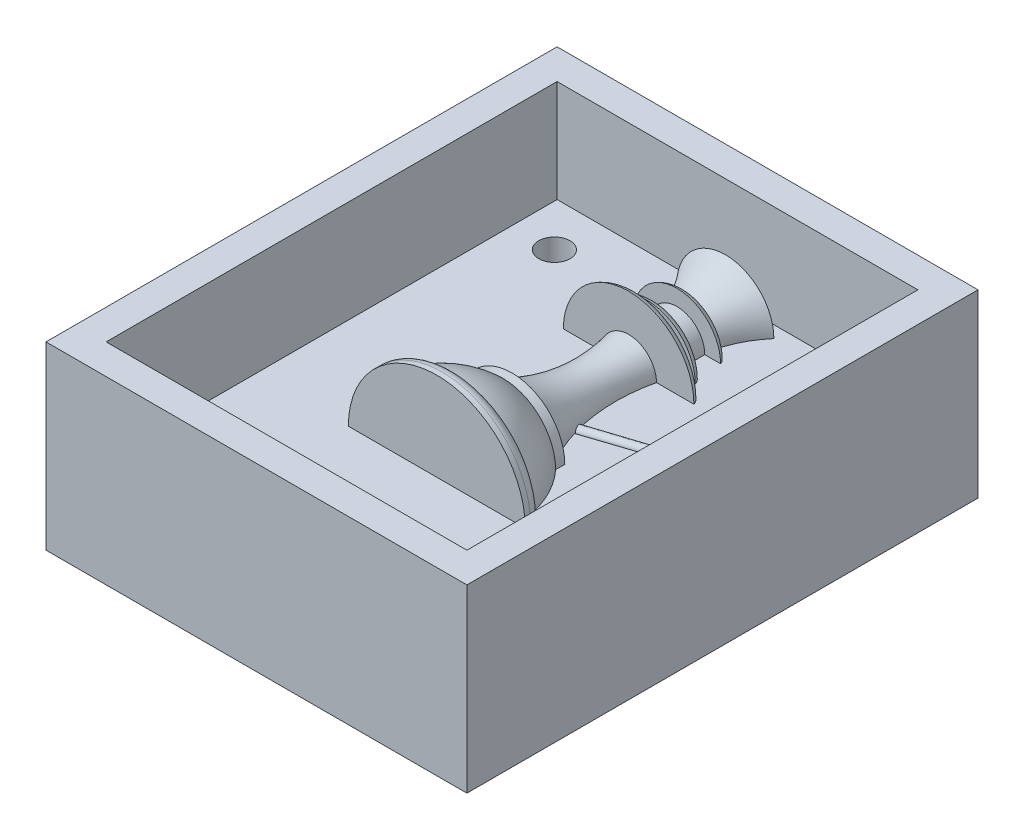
ISO-10303-21;
HEADER;
FILE_DESCRIPTION(('STEP AP214'),'2;1');
FILE_NAME('part.step','',(''),(''),'','','');
FILE_SCHEMA(('AUTOMOTIVE_DESIGN { 1 0 10303 214 1 1 1 1 }'));
ENDSEC;
DATA;
#1=APPLICATION_CONTEXT('core data for automotive mechanical design processes');
#2=APPLICATION_PROTOCOL_DEFINITION('international standard','automotive_design',2000,#1);
#3=PRODUCT_CONTEXT('',#1,'mechanical');
#4=PRODUCT('Part','Part','',(#3));
#5=PRODUCT_RELATED_PRODUCT_CATEGORY('part','',(#4));
#6=PRODUCT_DEFINITION_FORMATION('','',#4);
#7=PRODUCT_DEFINITION_CONTEXT('part definition',#1,'design');
#8=PRODUCT_DEFINITION('design','',#6,#7);
#9=PRODUCT_DEFINITION_SHAPE('','',#8);
#10=(LENGTH_UNIT() NAMED_UNIT(*) SI_UNIT(.MILLI.,.METRE.));
#11=(NAMED_UNIT(*) PLANE_ANGLE_UNIT() SI_UNIT($,.RADIAN.));
#12=(NAMED_UNIT(*) SI_UNIT($,.STERADIAN.) SOLID_ANGLE_UNIT());
#13=UNCERTAINTY_MEASURE_WITH_UNIT(LENGTH_MEASURE(1.E-05),#10,'distance_accuracy_value','');
#14=(GEOMETRIC_REPRESENTATION_CONTEXT(3) GLOBAL_UNCERTAINTY_ASSIGNED_CONTEXT((#13)) GLOBAL_UNIT_ASSIGNED_CONTEXT((#10,
#11,#12)) REPRESENTATION_CONTEXT('',''));
#15=CARTESIAN_POINT('',(0.,0.,0.));
#16=DIRECTION('',(0.,0.,1.));
#17=DIRECTION('',(1.,0.,0.));
#18=AXIS2_PLACEMENT_3D('',#15,#16,#17);
#19=CARTESIAN_POINT('',(0.,13.,0.));
#20=DIRECTION('',(0.,1.,0.));
#21=DIRECTION('',(0.,0.,1.));
#22=AXIS2_PLACEMENT_3D('',#19,#20,#21);
#23=PLANE('',#22);
#24=DIRECTION('',(0.145838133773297,0.,0.989308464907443));
#25=VECTOR('',#24,1.);
#26=CARTESIAN_POINT('',(30.,13.,-14.1966660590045));
#27=LINE('',#26,#25);
#28=CARTESIAN_POINT('',(30.,13.,-14.1966660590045));
#29=VERTEX_POINT('',#28);
#30=CARTESIAN_POINT('',(29.8979133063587,13.,-14.8891819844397));
#31=VERTEX_POINT('',#30);
#32=EDGE_CURVE('E353',#29,#31,#27,.F.);
#33=ORIENTED_EDGE('',*,*,#32,.F.);
#34=DIRECTION('',(0.,0.,-1.));
#35=VECTOR('',#34,1.);
#36=CARTESIAN_POINT('',(30.,13.,37.5));
#37=LINE('',#36,#35);
#38=CARTESIAN_POINT('',(30.,13.,-37.5));
#39=VERTEX_POINT('',#38);
#40=EDGE_CURVE('E349',#29,#39,#37,.T.);
#41=ORIENTED_EDGE('',*,*,#40,.T.);
#42=DIRECTION('',(-1.,0.,0.));
#43=VECTOR('',#42,1.);
#44=CARTESIAN_POINT('',(30.,13.,-37.5));
#45=LINE('',#44,#43);
#46=CARTESIAN_POINT('',(1.76,13.,-37.5));
#47=VERTEX_POINT('',#46);
#48=EDGE_CURVE('E964',#39,#47,#45,.T.);
#49=ORIENTED_EDGE('',*,*,#48,.T.);
#50=DIRECTION('',(0.,0.,-1.));
#51=VECTOR('',#50,1.);
#52=CARTESIAN_POINT('',(1.76,13.,-42.5));
#53=LINE('',#52,#51);
#54=CARTESIAN_POINT('',(1.76,13.,-35.5));
#55=VERTEX_POINT('',#54);
#56=EDGE_CURVE('E313',#47,#55,#53,.F.);
#57=ORIENTED_EDGE('',*,*,#56,.T.);
#58=DIRECTION('',(1.,0.,0.));
#59=VECTOR('',#58,1.);
#60=CARTESIAN_POINT('',(0.,13.,-35.5));
#61=LINE('',#60,#59);
#62=CARTESIAN_POINT('',(8.05528343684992,13.,-35.5));
#63=VERTEX_POINT('',#62);
#64=EDGE_CURVE('E311',#55,#63,#61,.T.);
#65=ORIENTED_EDGE('',*,*,#64,.T.);
#66=CARTESIAN_POINT('',(20.2084994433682,13.,-25.062448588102));
#67=DIRECTION('',(0.,1.,0.));
#68=DIRECTION('',(0.,0.,1.));
#69=AXIS2_PLACEMENT_3D('',#66,#67,#68);
#70=CIRCLE('',#69,16.0200854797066);
#71=CARTESIAN_POINT('',(4.62528343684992,13.,-28.7781608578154));
#72=VERTEX_POINT('',#71);
#73=EDGE_CURVE('E308',#63,#72,#70,.T.);
#74=ORIENTED_EDGE('',*,*,#73,.T.);
#75=DIRECTION('',(1.,0.,0.));
#76=VECTOR('',#75,1.);
#77=CARTESIAN_POINT('',(0.,13.,-28.7781608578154));
#78=LINE('',#77,#76);
#79=CARTESIAN_POINT('',(5.35732157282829,13.,-28.7781608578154));
#80=VERTEX_POINT('',#79);
#81=EDGE_CURVE('E312',#72,#80,#78,.T.);
#82=ORIENTED_EDGE('',*,*,#81,.T.);
#83=CARTESIAN_POINT('',(5.35732157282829,13.,-26.7781608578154));
#84=DIRECTION('',(0.,1.,0.));
#85=DIRECTION('',(0.,0.,1.));
#86=AXIS2_PLACEMENT_3D('',#83,#84,#85);
#87=CIRCLE('',#86,2.);
#88=CARTESIAN_POINT('',(7.24528343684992,13.,-27.4381608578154));
#89=VERTEX_POINT('',#88);
#90=EDGE_CURVE('E56',#80,#89,#87,.F.);
#91=ORIENTED_EDGE('',*,*,#90,.T.);
#92=DIRECTION('',(-1.,0.,0.));
#93=VECTOR('',#92,1.);
#94=CARTESIAN_POINT('',(0.,13.,-27.4381608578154));
#95=LINE('',#94,#93);
#96=CARTESIAN_POINT('',(4.62528343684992,13.,-27.4381608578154));
#97=VERTEX_POINT('',#96);
#98=EDGE_CURVE('E306',#89,#97,#95,.T.);
#99=ORIENTED_EDGE('',*,*,#98,.T.);
#100=DIRECTION('',(0.,0.,-1.));
#101=VECTOR('',#100,1.);
#102=CARTESIAN_POINT('',(4.62528343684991,13.,-42.5));
#103=LINE('',#102,#101);
#104=CARTESIAN_POINT('',(4.62528343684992,13.,-23.8581608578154));
#105=VERTEX_POINT('',#104);
#106=EDGE_CURVE('E303',#97,#105,#103,.F.);
#107=ORIENTED_EDGE('',*,*,#106,.T.);
#108=DIRECTION('',(1.,0.,0.));
#109=VECTOR('',#108,1.);
#110=CARTESIAN_POINT('',(0.,13.,-23.8581608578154));
#111=LINE('',#110,#109);
#112=CARTESIAN_POINT('',(6.13822840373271,13.,-23.8581608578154));
#113=VERTEX_POINT('',#112);
#114=EDGE_CURVE('E307',#105,#113,#111,.T.);
#115=ORIENTED_EDGE('',*,*,#114,.T.);
#116=CARTESIAN_POINT('',(6.13822840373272,13.,-21.8581608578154));
#117=DIRECTION('',(0.,1.,0.));
#118=DIRECTION('',(0.,0.,1.));
#119=AXIS2_PLACEMENT_3D('',#116,#117,#118);
#120=CIRCLE('',#119,2.);
#121=CARTESIAN_POINT('',(8.05528343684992,13.,-22.4281608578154));
#122=VERTEX_POINT('',#121);
#123=EDGE_CURVE('E334',#113,#122,#120,.F.);
#124=ORIENTED_EDGE('',*,*,#123,.T.);
#125=DIRECTION('',(-1.,0.,0.));
#126=VECTOR('',#125,1.);
#127=CARTESIAN_POINT('',(0.,13.,-22.4281608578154));
#128=LINE('',#127,#126);
#129=CARTESIAN_POINT('',(4.62528343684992,13.,-22.4281608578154));
#130=VERTEX_POINT('',#129);
#131=EDGE_CURVE('E302',#122,#130,#128,.T.);
#132=ORIENTED_EDGE('',*,*,#131,.T.);
#133=DIRECTION('',(0.,0.,-1.));
#134=VECTOR('',#133,1.);
#135=CARTESIAN_POINT('',(4.62528343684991,13.,-42.5));
#136=LINE('',#135,#134);
#137=CARTESIAN_POINT('',(4.62528343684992,13.,-20.8281608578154));
#138=VERTEX_POINT('',#137);
#139=EDGE_CURVE('E299',#130,#138,#136,.F.);
#140=ORIENTED_EDGE('',*,*,#139,.T.);
#141=DIRECTION('',(1.,0.,0.));
#142=VECTOR('',#141,1.);
#143=CARTESIAN_POINT('',(0.,13.,-20.8281608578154));
#144=LINE('',#143,#142);
#145=CARTESIAN_POINT('',(8.93822840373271,13.,-20.8281608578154));
#146=VERTEX_POINT('',#145);
#147=EDGE_CURVE('E292',#138,#146,#144,.T.);
#148=ORIENTED_EDGE('',*,*,#147,.T.);
#149=CARTESIAN_POINT('',(8.93822840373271,13.,-18.8281608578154));
#150=DIRECTION('',(0.,1.,0.));
#151=DIRECTION('',(0.,0.,1.));
#152=AXIS2_PLACEMENT_3D('',#149,#150,#151);
#153=CIRCLE('',#152,2.);
#154=CARTESIAN_POINT('',(10.8552834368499,13.,-19.3981608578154));
#155=VERTEX_POINT('',#154);
#156=EDGE_CURVE('E330',#146,#155,#153,.F.);
#157=ORIENTED_EDGE('',*,*,#156,.T.);
#158=DIRECTION('',(-1.,0.,0.));
#159=VECTOR('',#158,1.);
#160=CARTESIAN_POINT('',(0.,13.,-19.3981608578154));
#161=LINE('',#160,#159);
#162=CARTESIAN_POINT('',(4.62528343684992,13.,-19.3981608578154));
#163=VERTEX_POINT('',#162);
#164=EDGE_CURVE('E291',#155,#163,#161,.T.);
#165=ORIENTED_EDGE('',*,*,#164,.T.);
#166=CARTESIAN_POINT('',(31.5891164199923,13.,-13.3029481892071));
#167=DIRECTION('',(0.,1.,0.));
#168=DIRECTION('',(0.,0.,1.));
#169=AXIS2_PLACEMENT_3D('',#166,#167,#168);
#170=CIRCLE('',#169,27.6441658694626);
#171=CARTESIAN_POINT('',(4.93175809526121,13.,-5.9827600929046));
#172=VERTEX_POINT('',#171);
#173=EDGE_CURVE('E282',#163,#172,#170,.T.);
#174=ORIENTED_EDGE('',*,*,#173,.T.);
#175=DIRECTION('',(0.218026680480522,0.,0.975942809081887));
#176=VECTOR('',#175,1.);
#177=CARTESIAN_POINT('',(4.93175809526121,13.,-5.9827600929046));
#178=LINE('',#177,#176);
#179=CARTESIAN_POINT('',(4.76509412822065,13.,-6.72879034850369));
#180=VERTEX_POINT('',#179);
#181=EDGE_CURVE('E41',#180,#172,#178,.T.);
#182=ORIENTED_EDGE('',*,*,#181,.F.);
#183=DIRECTION('',(-0.95112051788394,0.,0.308819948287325));
#184=VECTOR('',#183,1.);
#185=CARTESIAN_POINT('',(274.234734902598,13.,-94.2230657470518));
#186=LINE('',#185,#184);
#187=EDGE_CURVE('E357',#31,#180,#186,.T.);
#188=ORIENTED_EDGE('',*,*,#187,.F.);
#189=EDGE_LOOP('',(#33,#41,#49,#57,#65,#74,#82,#91,#99,#107,#115,#124,#132,#140,#148,#157,#165,
#174,#182,#188));
#190=FACE_BOUND('',#189,.T.);
#191=ADVANCED_FACE('F33',(#190),#23,.T.);
#192=CARTESIAN_POINT('',(0.,0.,0.));
#193=DIRECTION('',(0.,1.,0.));
#194=DIRECTION('',(0.,0.,1.));
#195=AXIS2_PLACEMENT_3D('',#192,#193,#194);
#196=PLANE('',#195);
#197=DIRECTION('',(0.,0.,-1.));
#198=VECTOR('',#197,1.);
#199=CARTESIAN_POINT('',(35.,0.,-42.5));
#200=LINE('',#199,#198);
#201=CARTESIAN_POINT('',(35.,0.,42.5));
#202=VERTEX_POINT('',#201);
#203=CARTESIAN_POINT('',(35.,0.,-42.5));
#204=VERTEX_POINT('',#203);
#205=EDGE_CURVE('E490',#202,#204,#200,.T.);
#206=ORIENTED_EDGE('',*,*,#205,.F.);
#207=DIRECTION('',(1.,0.,0.));
#208=VECTOR('',#207,1.);
#209=CARTESIAN_POINT('',(-35.,0.,42.5));
#210=LINE('',#209,#208);
#211=CARTESIAN_POINT('',(-35.,0.,42.5));
#212=VERTEX_POINT('',#211);
#213=EDGE_CURVE('E861',#212,#202,#210,.T.);
#214=ORIENTED_EDGE('',*,*,#213,.F.);
#215=DIRECTION('',(0.,0.,1.));
#216=VECTOR('',#215,1.);
#217=CARTESIAN_POINT('',(-35.,0.,-42.5));
#218=LINE('',#217,#216);
#219=CARTESIAN_POINT('',(-35.,0.,-42.5));
#220=VERTEX_POINT('',#219);
#221=EDGE_CURVE('E852',#220,#212,#218,.T.);
#222=ORIENTED_EDGE('',*,*,#221,.F.);
#223=DIRECTION('',(-1.,0.,0.));
#224=VECTOR('',#223,1.);
#225=CARTESIAN_POINT('',(-35.,0.,-42.5));
#226=LINE('',#225,#224);
#227=EDGE_CURVE('E849',#204,#220,#226,.T.);
#228=ORIENTED_EDGE('',*,*,#227,.F.);
#229=EDGE_LOOP('',(#206,#214,#222,#228));
#230=FACE_BOUND('',#229,.T.);
#231=DIRECTION('',(-1.,0.,0.));
#232=VECTOR('',#231,1.);
#233=CARTESIAN_POINT('',(0.,0.,12.5));
#234=LINE('',#233,#232);
#235=CARTESIAN_POINT('',(6.8889816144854,0.,12.5));
#236=VERTEX_POINT('',#235);
#237=CARTESIAN_POINT('',(-6.8889816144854,0.,12.5));
#238=VERTEX_POINT('',#237);
#239=EDGE_CURVE('E492',#236,#238,#234,.T.);
#240=ORIENTED_EDGE('',*,*,#239,.F.);
#241=DIRECTION('',(0.,0.,-1.));
#242=VECTOR('',#241,1.);
#243=CARTESIAN_POINT('',(6.88898161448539,0.,-42.5));
#244=LINE('',#243,#242);
#245=CARTESIAN_POINT('',(6.8889816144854,0.,9.6367311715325));
#246=VERTEX_POINT('',#245);
#247=EDGE_CURVE('E494',#246,#236,#244,.F.);
#248=ORIENTED_EDGE('',*,*,#247,.F.);
#249=DIRECTION('',(1.,0.,0.));
#250=VECTOR('',#249,1.);
#251=CARTESIAN_POINT('',(0.,0.,9.63673117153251));
#252=LINE('',#251,#250);
#253=CARTESIAN_POINT('',(1.28522039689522,0.,9.6367311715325));
#254=VERTEX_POINT('',#253);
#255=EDGE_CURVE('E421',#254,#246,#252,.T.);
#256=ORIENTED_EDGE('',*,*,#255,.F.);
#257=CARTESIAN_POINT('',(0.,0.,9.36666581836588));
#258=CARTESIAN_POINT('',(0.192582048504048,0.,9.36668142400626));
#259=CARTESIAN_POINT('',(0.385426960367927,0.,9.38439830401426));
#260=CARTESIAN_POINT('',(0.764982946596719,0.,9.4543302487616));
#261=CARTESIAN_POINT('',(0.951680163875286,0.,9.50661830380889));
#262=CARTESIAN_POINT('',(1.31234993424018,0.,9.64259346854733));
#263=CARTESIAN_POINT('',(1.48637032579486,0.,9.72615435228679));
#264=CARTESIAN_POINT('',(1.81815137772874,0.,9.92070220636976));
#265=CARTESIAN_POINT('',(1.975915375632,0.,10.0316835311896));
#266=CARTESIAN_POINT('',(2.27483005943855,0.,10.2788012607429));
#267=CARTESIAN_POINT('',(2.41564851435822,0.,10.4153373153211));
#268=CARTESIAN_POINT('',(2.67549395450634,0.,10.7077113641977));
#269=CARTESIAN_POINT('',(2.79451412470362,0.,10.8635553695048));
#270=CARTESIAN_POINT('',(3.02329316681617,0.,11.2111819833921));
#271=CARTESIAN_POINT('',(3.12993816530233,0.,11.4050134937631));
#272=CARTESIAN_POINT('',(3.31312290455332,0.,11.8064089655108));
#273=CARTESIAN_POINT('',(3.38964621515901,0.,12.0139803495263));
#274=CARTESIAN_POINT('',(3.51935866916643,0.,12.462972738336));
#275=CARTESIAN_POINT('',(3.5687342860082,0.,12.7054997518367));
#276=CARTESIAN_POINT('',(3.62905168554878,0.,13.1953104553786));
#277=CARTESIAN_POINT('',(3.63997750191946,0.,13.4425960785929));
#278=CARTESIAN_POINT('',(3.62273212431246,0.,13.9533410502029));
#279=CARTESIAN_POINT('',(3.59174946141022,0.,14.2167111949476));
#280=CARTESIAN_POINT('',(3.4857510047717,0.,14.7345569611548));
#281=CARTESIAN_POINT('',(3.41072538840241,0.,14.9890305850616));
#282=CARTESIAN_POINT('',(3.21784308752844,0.,15.4791166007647));
#283=CARTESIAN_POINT('',(3.10031301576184,0.,15.7148565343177));
#284=CARTESIAN_POINT('',(2.82354595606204,0.,16.1606021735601));
#285=CARTESIAN_POINT('',(2.66432882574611,0.,16.370620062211));
#286=CARTESIAN_POINT('',(2.32346245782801,0.,16.7371135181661));
#287=CARTESIAN_POINT('',(2.14520714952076,0.,16.8967323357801));
#288=CARTESIAN_POINT('',(1.760818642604,0.,17.1778895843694));
#289=CARTESIAN_POINT('',(1.55472154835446,0.,17.2994766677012));
#290=CARTESIAN_POINT('',(1.15167511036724,0.,17.4829650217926));
#291=CARTESIAN_POINT('',(0.957427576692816,0.,17.5508087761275));
#292=CARTESIAN_POINT('',(0.55961252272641,0.,17.6484166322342));
#293=CARTESIAN_POINT('',(0.356053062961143,0.,17.6782130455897));
#294=CARTESIAN_POINT('',(-0.0306959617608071,0.,17.6968094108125));
#295=CARTESIAN_POINT('',(-0.213699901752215,0.,17.6897058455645));
#296=CARTESIAN_POINT('',(-0.575739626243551,0.,17.6441930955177));
#297=CARTESIAN_POINT('',(-0.754776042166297,0.,17.6057889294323));
#298=CARTESIAN_POINT('',(-1.10048109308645,0.,17.5006450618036));
#299=CARTESIAN_POINT('',(-1.26732133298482,0.,17.4344643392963));
#300=CARTESIAN_POINT('',(-1.58851058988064,0.,17.2767571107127));
#301=CARTESIAN_POINT('',(-1.74285700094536,0.,17.1852253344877));
#302=CARTESIAN_POINT('',(-2.04607388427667,0.,16.9733009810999));
#303=CARTESIAN_POINT('',(-2.19387034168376,0.,16.8513766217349));
#304=CARTESIAN_POINT('',(-2.46956632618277,0.,16.5868451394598));
#305=CARTESIAN_POINT('',(-2.59745751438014,0.,16.4442293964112));
#306=CARTESIAN_POINT('',(-2.84566286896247,0.,16.1246423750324));
#307=CARTESIAN_POINT('',(-2.96331241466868,0.,15.9456031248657));
#308=CARTESIAN_POINT('',(-3.1707364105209,0.,15.5720740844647));
#309=CARTESIAN_POINT('',(-3.26049725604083,0.,15.3775768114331));
#310=CARTESIAN_POINT('',(-3.42090730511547,0.,14.9530371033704));
#311=CARTESIAN_POINT('',(-3.48781113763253,0.,14.7215762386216));
#312=CARTESIAN_POINT('',(-3.58527835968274,0.,14.251112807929));
#313=CARTESIAN_POINT('',(-3.61582491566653,0.,14.0121068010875));
#314=CARTESIAN_POINT('',(-3.64149301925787,0.,13.5113675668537));
#315=CARTESIAN_POINT('',(-3.63331609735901,0.,13.2494593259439));
#316=CARTESIAN_POINT('',(-3.57387396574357,0.,12.7304885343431));
#317=CARTESIAN_POINT('',(-3.52259596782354,0.,12.4734274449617));
#318=CARTESIAN_POINT('',(-3.3761000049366,0.,11.9678637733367));
#319=CARTESIAN_POINT('',(-3.28023831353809,0.,11.7195459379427));
#320=CARTESIAN_POINT('',(-3.04511476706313,0.,11.2442257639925));
#321=CARTESIAN_POINT('',(-2.90586495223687,0.,11.0172175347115));
#322=CARTESIAN_POINT('',(-2.59734140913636,0.,10.6094223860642));
#323=CARTESIAN_POINT('',(-2.4309100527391,0.,10.4264956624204));
#324=CARTESIAN_POINT('',(-2.06548885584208,0.,10.0964421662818));
#325=CARTESIAN_POINT('',(-1.86652339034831,0.,9.94928879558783));
#326=CARTESIAN_POINT('',(-1.47021709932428,0.,9.71649137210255));
#327=CARTESIAN_POINT('',(-1.2761373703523,0.,9.62528819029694));
#328=CARTESIAN_POINT('',(-0.874284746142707,0.,9.48229022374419));
#329=CARTESIAN_POINT('',(-0.666557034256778,0.,9.43037188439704));
#330=CARTESIAN_POINT('',(-0.380579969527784,0.,9.38872461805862));
#331=CARTESIAN_POINT('',(-0.304715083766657,0.,9.38046545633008));
#332=CARTESIAN_POINT('',(-0.152580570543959,0.,9.36943282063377));
#333=CARTESIAN_POINT('',(-0.0763109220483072,0.,9.36665963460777));
#334=CARTESIAN_POINT('',(0.,0.,9.36666581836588));
#335=B_SPLINE_CURVE_WITH_KNOTS('',3,(#257,#258,#259,#260,#261,#262,#263,#264,#265,#266,#267,
#268,#269,#270,#271,#272,#273,#274,#275,#276,#277,#278,#279,#280,#281,#282,#283,#284,#285,#286,
#287,#288,#289,#290,#291,#292,#293,#294,#295,#296,#297,#298,#299,#300,#301,#302,#303,#304,#305,
#306,#307,#308,#309,#310,#311,#312,#313,#314,#315,#316,#317,#318,#319,#320,#321,#322,#323,#324,
#325,#326,#327,#328,#329,#330,#331,#332,#333,#334),.UNSPECIFIED.,.T.,.F.,(4,2,2,2,2,2,2,2,2,2,2,
2,2,2,2,2,2,2,2,2,2,2,2,2,2,2,2,2,2,2,2,2,2,2,2,2,2,2,4),(0.,0.577410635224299,1.15604427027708,
1.73236713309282,2.30857143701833,2.89468146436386,3.48097442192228,4.14199362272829,
4.80337288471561,5.54270834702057,6.28235078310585,7.07415303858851,7.8661319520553,
8.65215013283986,9.43779457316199,10.1514248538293,10.8641384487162,11.4779130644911,
12.0911660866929,12.6378964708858,13.184539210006,13.7206721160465,14.2569165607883,
14.8293808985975,15.4020844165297,16.0422117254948,16.6826508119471,17.4024325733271,
18.1225474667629,18.9050522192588,19.6877892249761,20.4821964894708,21.2763835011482,
22.0140443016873,22.7511549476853,23.3908400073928,24.0285047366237,24.2572925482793,
24.4860923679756),.UNSPECIFIED.);
#336=CARTESIAN_POINT('',(-1.28522039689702,0.,9.63673117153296));
#337=VERTEX_POINT('',#336);
#338=EDGE_CURVE('E414',#337,#254,#335,.T.);
#339=ORIENTED_EDGE('',*,*,#338,.F.);
#340=CARTESIAN_POINT('',(-6.8889816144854,0.,9.63673117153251));
#341=VERTEX_POINT('',#340);
#342=EDGE_CURVE('E1002',#341,#337,#252,.T.);
#343=ORIENTED_EDGE('',*,*,#342,.F.);
#344=DIRECTION('',(0.,0.,-1.));
#345=VECTOR('',#344,1.);
#346=CARTESIAN_POINT('',(-6.88898161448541,0.,-42.5));
#347=LINE('',#346,#345);
#348=EDGE_CURVE('E497',#238,#341,#347,.T.);
#349=ORIENTED_EDGE('',*,*,#348,.F.);
#350=EDGE_LOOP('',(#240,#248,#256,#339,#343,#349));
#351=FACE_BOUND('',#350,.T.);
#352=ADVANCED_FACE('F423',(#230,#351),#196,.F.);
#353=CARTESIAN_POINT('',(23.,13.,30.5));
#354=DIRECTION('',(0.,1.,0.));
#355=DIRECTION('',(0.,0.,1.));
#356=AXIS2_PLACEMENT_3D('',#353,#354,#355);
#357=CIRCLE('',#356,2.6);
#358=CARTESIAN_POINT('',(23.,13.,33.1));
#359=VERTEX_POINT('',#358);
#360=EDGE_CURVE('E1030',#359,#359,#357,.T.);
#361=ORIENTED_EDGE('',*,*,#360,.F.);
#362=EDGE_LOOP('',(#361));
#363=FACE_BOUND('',#362,.T.);
#364=CARTESIAN_POINT('',(-23.,13.,-30.0513648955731));
#365=DIRECTION('',(0.,1.,0.));
#366=DIRECTION('',(0.,0.,1.));
#367=AXIS2_PLACEMENT_3D('',#364,#365,#366);
#368=CIRCLE('',#367,2.6);
#369=CARTESIAN_POINT('',(-23.,13.,-27.4513648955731));
#370=VERTEX_POINT('',#369);
#371=EDGE_CURVE('E1034',#370,#370,#368,.T.);
#372=ORIENTED_EDGE('',*,*,#371,.F.);
#373=EDGE_LOOP('',(#372));
#374=FACE_BOUND('',#373,.T.);
#375=DIRECTION('',(0.949448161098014,0.,-0.313923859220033));
#376=VECTOR('',#375,1.);
#377=CARTESIAN_POINT('',(274.234734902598,13.,-94.2230657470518));
#378=LINE('',#377,#376);
#379=CARTESIAN_POINT('',(5.23890304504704,13.,-5.2827600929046));
#380=VERTEX_POINT('',#379);
#381=CARTESIAN_POINT('',(30.,13.,-13.469725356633));
#382=VERTEX_POINT('',#381);
#383=EDGE_CURVE('E48',#380,#382,#378,.T.);
#384=ORIENTED_EDGE('',*,*,#383,.F.);
#385=DIRECTION('',(0.401801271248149,0.,0.915726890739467));
#386=VECTOR('',#385,1.);
#387=CARTESIAN_POINT('',(4.93175809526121,13.,-5.9827600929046));
#388=LINE('',#387,#386);
#389=EDGE_CURVE('E11',#172,#380,#388,.T.);
#390=ORIENTED_EDGE('',*,*,#389,.F.);
#391=CARTESIAN_POINT('',(7.35625699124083,13.,0.));
#392=VERTEX_POINT('',#391);
#393=EDGE_CURVE('E275',#172,#392,#170,.T.);
#394=ORIENTED_EDGE('',*,*,#393,.T.);
#395=DIRECTION('',(1.,0.,0.));
#396=VECTOR('',#395,1.);
#397=CARTESIAN_POINT('',(0.,13.,0.));
#398=LINE('',#397,#396);
#399=CARTESIAN_POINT('',(8.7791536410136,13.,0.));
#400=VERTEX_POINT('',#399);
#401=EDGE_CURVE('E286',#392,#400,#398,.T.);
#402=ORIENTED_EDGE('',*,*,#401,.T.);
#403=DIRECTION('',(0.,0.,-1.));
#404=VECTOR('',#403,1.);
#405=CARTESIAN_POINT('',(8.77915364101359,13.,-42.5));
#406=LINE('',#405,#404);
#407=CARTESIAN_POINT('',(8.7791536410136,13.,1.52405486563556));
#408=VERTEX_POINT('',#407);
#409=EDGE_CURVE('E297',#400,#408,#406,.F.);
#410=ORIENTED_EDGE('',*,*,#409,.T.);
#411=CARTESIAN_POINT('',(-4.13068325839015,13.,13.5291745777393));
#412=DIRECTION('',(0.,1.,0.));
#413=DIRECTION('',(0.,0.,1.));
#414=AXIS2_PLACEMENT_3D('',#411,#412,#413);
#415=CIRCLE('',#414,17.6291459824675);
#416=CARTESIAN_POINT('',(13.0633759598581,13.,9.6367311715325));
#417=VERTEX_POINT('',#416);
#418=EDGE_CURVE('E919',#408,#417,#415,.F.);
#419=ORIENTED_EDGE('',*,*,#418,.T.);
#420=CARTESIAN_POINT('',(12.7125139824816,13.,11.6057146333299));
#421=DIRECTION('',(0.,1.,0.));
#422=DIRECTION('',(0.,0.,1.));
#423=AXIS2_PLACEMENT_3D('',#420,#421,#422);
#424=CIRCLE('',#423,2.);
#425=CARTESIAN_POINT('',(14.7125139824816,13.,11.6057146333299));
#426=VERTEX_POINT('',#425);
#427=EDGE_CURVE('E318',#417,#426,#424,.F.);
#428=ORIENTED_EDGE('',*,*,#427,.T.);
#429=DIRECTION('',(0.,0.,-1.));
#430=VECTOR('',#429,1.);
#431=CARTESIAN_POINT('',(14.7125139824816,13.,-42.5));
#432=LINE('',#431,#430);
#433=CARTESIAN_POINT('',(14.7125139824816,13.,12.5));
#434=VERTEX_POINT('',#433);
#435=EDGE_CURVE('E918',#426,#434,#432,.F.);
#436=ORIENTED_EDGE('',*,*,#435,.T.);
#437=DIRECTION('',(-1.,0.,0.));
#438=VECTOR('',#437,1.);
#439=CARTESIAN_POINT('',(0.,13.,12.5));
#440=LINE('',#439,#438);
#441=CARTESIAN_POINT('',(-14.7125139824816,13.,12.5));
#442=VERTEX_POINT('',#441);
#443=EDGE_CURVE('E915',#434,#442,#440,.T.);
#444=ORIENTED_EDGE('',*,*,#443,.T.);
#445=DIRECTION('',(0.,0.,-1.));
#446=VECTOR('',#445,1.);
#447=CARTESIAN_POINT('',(-14.7125139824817,13.,-42.5));
#448=LINE('',#447,#446);
#449=CARTESIAN_POINT('',(-14.7125139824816,13.,11.6057146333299));
#450=VERTEX_POINT('',#449);
#451=EDGE_CURVE('E912',#442,#450,#448,.T.);
#452=ORIENTED_EDGE('',*,*,#451,.T.);
#453=CARTESIAN_POINT('',(-12.7125139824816,13.,11.6057146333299));
#454=DIRECTION('',(0.,1.,0.));
#455=DIRECTION('',(0.,0.,1.));
#456=AXIS2_PLACEMENT_3D('',#453,#454,#455);
#457=CIRCLE('',#456,2.);
#458=CARTESIAN_POINT('',(-13.0633759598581,13.,9.6367311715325));
#459=VERTEX_POINT('',#458);
#460=EDGE_CURVE('E320',#450,#459,#457,.F.);
#461=ORIENTED_EDGE('',*,*,#460,.T.);
#462=CARTESIAN_POINT('',(4.13068325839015,13.,13.5291745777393));
#463=DIRECTION('',(0.,1.,0.));
#464=DIRECTION('',(0.,0.,1.));
#465=AXIS2_PLACEMENT_3D('',#462,#463,#464);
#466=CIRCLE('',#465,17.6291459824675);
#467=CARTESIAN_POINT('',(-8.77915364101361,13.,1.52405486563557));
#468=VERTEX_POINT('',#467);
#469=EDGE_CURVE('E909',#459,#468,#466,.F.);
#470=ORIENTED_EDGE('',*,*,#469,.T.);
#471=DIRECTION('',(0.,0.,-1.));
#472=VECTOR('',#471,1.);
#473=CARTESIAN_POINT('',(-8.77915364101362,13.,-42.5));
#474=LINE('',#473,#472);
#475=CARTESIAN_POINT('',(-8.77915364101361,13.,0.));
#476=VERTEX_POINT('',#475);
#477=EDGE_CURVE('E906',#468,#476,#474,.T.);
#478=ORIENTED_EDGE('',*,*,#477,.T.);
#479=CARTESIAN_POINT('',(-7.35625699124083,13.,0.));
#480=VERTEX_POINT('',#479);
#481=EDGE_CURVE('E903',#476,#480,#398,.T.);
#482=ORIENTED_EDGE('',*,*,#481,.T.);
#483=CARTESIAN_POINT('',(-31.5891164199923,13.,-13.3029481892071));
#484=DIRECTION('',(0.,1.,0.));
#485=DIRECTION('',(0.,0.,1.));
#486=AXIS2_PLACEMENT_3D('',#483,#484,#485);
#487=CIRCLE('',#486,27.6441658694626);
#488=CARTESIAN_POINT('',(-4.62528343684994,13.,-19.3981608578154));
#489=VERTEX_POINT('',#488);
#490=EDGE_CURVE('E900',#480,#489,#487,.T.);
#491=ORIENTED_EDGE('',*,*,#490,.T.);
#492=CARTESIAN_POINT('',(-10.8552834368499,13.,-19.3981608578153));
#493=VERTEX_POINT('',#492);
#494=EDGE_CURVE('E294',#489,#493,#161,.T.);
#495=ORIENTED_EDGE('',*,*,#494,.T.);
#496=CARTESIAN_POINT('',(-8.93822840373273,13.,-18.8281608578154));
#497=DIRECTION('',(0.,1.,0.));
#498=DIRECTION('',(0.,0.,1.));
#499=AXIS2_PLACEMENT_3D('',#496,#497,#498);
#500=CIRCLE('',#499,2.);
#501=CARTESIAN_POINT('',(-8.93822840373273,13.,-20.8281608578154));
#502=VERTEX_POINT('',#501);
#503=EDGE_CURVE('E332',#493,#502,#500,.F.);
#504=ORIENTED_EDGE('',*,*,#503,.T.);
#505=CARTESIAN_POINT('',(-4.62528343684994,13.,-20.8281608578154));
#506=VERTEX_POINT('',#505);
#507=EDGE_CURVE('E897',#502,#506,#144,.T.);
#508=ORIENTED_EDGE('',*,*,#507,.T.);
#509=DIRECTION('',(0.,0.,-1.));
#510=VECTOR('',#509,1.);
#511=CARTESIAN_POINT('',(-4.62528343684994,13.,-42.5));
#512=LINE('',#511,#510);
#513=CARTESIAN_POINT('',(-4.62528343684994,13.,-22.4281608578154));
#514=VERTEX_POINT('',#513);
#515=EDGE_CURVE('E894',#506,#514,#512,.T.);
#516=ORIENTED_EDGE('',*,*,#515,.T.);
#517=CARTESIAN_POINT('',(-8.05528343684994,13.,-22.4281608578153));
#518=VERTEX_POINT('',#517);
#519=EDGE_CURVE('E891',#514,#518,#128,.T.);
#520=ORIENTED_EDGE('',*,*,#519,.T.);
#521=CARTESIAN_POINT('',(-6.13822840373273,13.,-21.8581608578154));
#522=DIRECTION('',(0.,1.,0.));
#523=DIRECTION('',(0.,0.,1.));
#524=AXIS2_PLACEMENT_3D('',#521,#522,#523);
#525=CIRCLE('',#524,2.);
#526=CARTESIAN_POINT('',(-6.13822840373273,13.,-23.8581608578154));
#527=VERTEX_POINT('',#526);
#528=EDGE_CURVE('E336',#518,#527,#525,.F.);
#529=ORIENTED_EDGE('',*,*,#528,.T.);
#530=CARTESIAN_POINT('',(-4.62528343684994,13.,-23.8581608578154));
#531=VERTEX_POINT('',#530);
#532=EDGE_CURVE('E889',#527,#531,#111,.T.);
#533=ORIENTED_EDGE('',*,*,#532,.T.);
#534=DIRECTION('',(0.,0.,-1.));
#535=VECTOR('',#534,1.);
#536=CARTESIAN_POINT('',(-4.62528343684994,13.,-42.5));
#537=LINE('',#536,#535);
#538=CARTESIAN_POINT('',(-4.62528343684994,13.,-27.4381608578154));
#539=VERTEX_POINT('',#538);
#540=EDGE_CURVE('E886',#531,#539,#537,.T.);
#541=ORIENTED_EDGE('',*,*,#540,.T.);
#542=CARTESIAN_POINT('',(-7.24528343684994,13.,-27.4381608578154));
#543=VERTEX_POINT('',#542);
#544=EDGE_CURVE('E883',#539,#543,#95,.T.);
#545=ORIENTED_EDGE('',*,*,#544,.T.);
#546=CARTESIAN_POINT('',(-5.35732157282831,13.,-26.7781608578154));
#547=DIRECTION('',(0.,1.,0.));
#548=DIRECTION('',(0.,0.,1.));
#549=AXIS2_PLACEMENT_3D('',#546,#547,#548);
#550=CIRCLE('',#549,2.);
#551=CARTESIAN_POINT('',(-5.35732157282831,13.,-28.7781608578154));
#552=VERTEX_POINT('',#551);
#553=EDGE_CURVE('E339',#543,#552,#550,.F.);
#554=ORIENTED_EDGE('',*,*,#553,.T.);
#555=CARTESIAN_POINT('',(-4.62528343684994,13.,-28.7781608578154));
#556=VERTEX_POINT('',#555);
#557=EDGE_CURVE('E881',#552,#556,#78,.T.);
#558=ORIENTED_EDGE('',*,*,#557,.T.);
#559=CARTESIAN_POINT('',(-20.2084994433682,13.,-25.062448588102));
#560=DIRECTION('',(0.,1.,0.));
#561=DIRECTION('',(0.,0.,1.));
#562=AXIS2_PLACEMENT_3D('',#559,#560,#561);
#563=CIRCLE('',#562,16.0200854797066);
#564=CARTESIAN_POINT('',(-8.05528343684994,13.,-35.5));
#565=VERTEX_POINT('',#564);
#566=EDGE_CURVE('E878',#556,#565,#563,.T.);
#567=ORIENTED_EDGE('',*,*,#566,.T.);
#568=CARTESIAN_POINT('',(-1.76000000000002,13.,-35.5));
#569=VERTEX_POINT('',#568);
#570=EDGE_CURVE('E875',#565,#569,#61,.T.);
#571=ORIENTED_EDGE('',*,*,#570,.T.);
#572=DIRECTION('',(0.,0.,-1.));
#573=VECTOR('',#572,1.);
#574=CARTESIAN_POINT('',(-1.76000000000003,13.,-42.5));
#575=LINE('',#574,#573);
#576=CARTESIAN_POINT('',(-1.76000000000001,13.,-37.5));
#577=VERTEX_POINT('',#576);
#578=EDGE_CURVE('E872',#569,#577,#575,.T.);
#579=ORIENTED_EDGE('',*,*,#578,.T.);
#580=CARTESIAN_POINT('',(-30.,13.,-37.5));
#581=VERTEX_POINT('',#580);
#582=EDGE_CURVE('E959',#577,#581,#45,.T.);
#583=ORIENTED_EDGE('',*,*,#582,.T.);
#584=DIRECTION('',(0.,0.,1.));
#585=VECTOR('',#584,1.);
#586=CARTESIAN_POINT('',(-30.,13.,-37.5));
#587=LINE('',#586,#585);
#588=CARTESIAN_POINT('',(-30.,13.,37.5));
#589=VERTEX_POINT('',#588);
#590=EDGE_CURVE('E967',#581,#589,#587,.T.);
#591=ORIENTED_EDGE('',*,*,#590,.T.);
#592=DIRECTION('',(1.,0.,0.));
#593=VECTOR('',#592,1.);
#594=CARTESIAN_POINT('',(-30.,13.,37.5));
#595=LINE('',#594,#593);
#596=CARTESIAN_POINT('',(30.,13.,37.5));
#597=VERTEX_POINT('',#596);
#598=EDGE_CURVE('E981',#589,#597,#595,.T.);
#599=ORIENTED_EDGE('',*,*,#598,.T.);
#600=EDGE_CURVE('E965',#597,#382,#37,.T.);
#601=ORIENTED_EDGE('',*,*,#600,.T.);
#602=EDGE_LOOP('',(#384,#390,#394,#402,#410,#419,#428,#436,#444,#452,#461,#470,#478,#482,#491,
#495,#504,#508,#516,#520,#529,#533,#541,#545,#554,#558,#567,#571,#579,#583,#591,#599,#601));
#603=FACE_BOUND('',#602,.T.);
#604=ADVANCED_FACE('F273',(#363,#374,#603),#23,.T.);
#605=CARTESIAN_POINT('',(35.,30.,-42.5));
#606=DIRECTION('',(-1.,0.,0.));
#607=DIRECTION('',(0.,0.,1.));
#608=AXIS2_PLACEMENT_3D('',#605,#606,#607);
#609=PLANE('',#608);
#610=ORIENTED_EDGE('',*,*,#205,.T.);
#611=DIRECTION('',(0.,-1.,0.));
#612=VECTOR('',#611,1.);
#613=CARTESIAN_POINT('',(35.,30.,-42.5));
#614=LINE('',#613,#612);
#615=CARTESIAN_POINT('',(35.,30.,-42.5));
#616=VERTEX_POINT('',#615);
#617=EDGE_CURVE('E846',#616,#204,#614,.T.);
#618=ORIENTED_EDGE('',*,*,#617,.F.);
#619=DIRECTION('',(0.,0.,-1.));
#620=VECTOR('',#619,1.);
#621=CARTESIAN_POINT('',(35.,30.,-42.5));
#622=LINE('',#621,#620);
#623=CARTESIAN_POINT('',(35.,30.,42.5));
#624=VERTEX_POINT('',#623);
#625=EDGE_CURVE('E863',#624,#616,#622,.T.);
#626=ORIENTED_EDGE('',*,*,#625,.F.);
#627=DIRECTION('',(0.,-1.,0.));
#628=VECTOR('',#627,1.);
#629=CARTESIAN_POINT('',(35.,30.,42.5));
#630=LINE('',#629,#628);
#631=EDGE_CURVE('E848',#624,#202,#630,.T.);
#632=ORIENTED_EDGE('',*,*,#631,.T.);
#633=EDGE_LOOP('',(#610,#618,#626,#632));
#634=FACE_BOUND('',#633,.T.);
#635=ADVANCED_FACE('F452',(#634),#609,.F.);
#636=CARTESIAN_POINT('',(-35.,30.,-42.5));
#637=DIRECTION('',(0.,0.,1.));
#638=DIRECTION('',(1.,0.,0.));
#639=AXIS2_PLACEMENT_3D('',#636,#637,#638);
#640=PLANE('',#639);
#641=ORIENTED_EDGE('',*,*,#227,.T.);
#642=DIRECTION('',(0.,-1.,0.));
#643=VECTOR('',#642,1.);
#644=CARTESIAN_POINT('',(-35.,30.,-42.5));
#645=LINE('',#644,#643);
#646=CARTESIAN_POINT('',(-35.,30.,-42.5));
#647=VERTEX_POINT('',#646);
#648=EDGE_CURVE('E868',#647,#220,#645,.T.);
#649=ORIENTED_EDGE('',*,*,#648,.F.);
#650=DIRECTION('',(-1.,0.,0.));
#651=VECTOR('',#650,1.);
#652=CARTESIAN_POINT('',(-35.,30.,-42.5));
#653=LINE('',#652,#651);
#654=EDGE_CURVE('E990',#616,#647,#653,.T.);
#655=ORIENTED_EDGE('',*,*,#654,.F.);
#656=ORIENTED_EDGE('',*,*,#617,.T.);
#657=EDGE_LOOP('',(#641,#649,#655,#656));
#658=FACE_BOUND('',#657,.T.);
#659=ADVANCED_FACE('F818',(#658),#640,.F.);
#660=CARTESIAN_POINT('',(-35.,30.,-42.5));
#661=DIRECTION('',(1.,0.,0.));
#662=DIRECTION('',(0.,0.,-1.));
#663=AXIS2_PLACEMENT_3D('',#660,#661,#662);
#664=PLANE('',#663);
#665=ORIENTED_EDGE('',*,*,#221,.T.);
#666=DIRECTION('',(0.,-1.,0.));
#667=VECTOR('',#666,1.);
#668=CARTESIAN_POINT('',(-35.,30.,42.5));
#669=LINE('',#668,#667);
#670=CARTESIAN_POINT('',(-35.,30.,42.5));
#671=VERTEX_POINT('',#670);
#672=EDGE_CURVE('E865',#671,#212,#669,.T.);
#673=ORIENTED_EDGE('',*,*,#672,.F.);
#674=DIRECTION('',(0.,0.,1.));
#675=VECTOR('',#674,1.);
#676=CARTESIAN_POINT('',(-35.,30.,-42.5));
#677=LINE('',#676,#675);
#678=EDGE_CURVE('E991',#647,#671,#677,.T.);
#679=ORIENTED_EDGE('',*,*,#678,.F.);
#680=ORIENTED_EDGE('',*,*,#648,.T.);
#681=EDGE_LOOP('',(#665,#673,#679,#680));
#682=FACE_BOUND('',#681,.T.);
#683=ADVANCED_FACE('F475',(#682),#664,.F.);
#684=CARTESIAN_POINT('',(-35.,30.,42.5));
#685=DIRECTION('',(0.,0.,-1.));
#686=DIRECTION('',(-1.,0.,0.));
#687=AXIS2_PLACEMENT_3D('',#684,#685,#686);
#688=PLANE('',#687);
#689=ORIENTED_EDGE('',*,*,#213,.T.);
#690=ORIENTED_EDGE('',*,*,#631,.F.);
#691=DIRECTION('',(1.,0.,0.));
#692=VECTOR('',#691,1.);
#693=CARTESIAN_POINT('',(-35.,30.,42.5));
#694=LINE('',#693,#692);
#695=EDGE_CURVE('E857',#671,#624,#694,.T.);
#696=ORIENTED_EDGE('',*,*,#695,.F.);
#697=ORIENTED_EDGE('',*,*,#672,.T.);
#698=EDGE_LOOP('',(#689,#690,#696,#697));
#699=FACE_BOUND('',#698,.T.);
#700=ADVANCED_FACE('F470',(#699),#688,.F.);
#701=CARTESIAN_POINT('',(0.,30.,0.));
#702=DIRECTION('',(0.,1.,0.));
#703=DIRECTION('',(0.,0.,1.));
#704=AXIS2_PLACEMENT_3D('',#701,#702,#703);
#705=PLANE('',#704);
#706=DIRECTION('',(1.,0.,0.));
#707=VECTOR('',#706,1.);
#708=CARTESIAN_POINT('',(-30.,30.,37.5));
#709=LINE('',#708,#707);
#710=CARTESIAN_POINT('',(-30.,30.,37.5));
#711=VERTEX_POINT('',#710);
#712=CARTESIAN_POINT('',(30.,30.,37.5));
#713=VERTEX_POINT('',#712);
#714=EDGE_CURVE('E501',#711,#713,#709,.T.);
#715=ORIENTED_EDGE('',*,*,#714,.F.);
#716=DIRECTION('',(0.,0.,1.));
#717=VECTOR('',#716,1.);
#718=CARTESIAN_POINT('',(-30.,30.,-37.5));
#719=LINE('',#718,#717);
#720=CARTESIAN_POINT('',(-30.,30.,-37.5));
#721=VERTEX_POINT('',#720);
#722=EDGE_CURVE('E979',#721,#711,#719,.T.);
#723=ORIENTED_EDGE('',*,*,#722,.F.);
#724=DIRECTION('',(-1.,0.,0.));
#725=VECTOR('',#724,1.);
#726=CARTESIAN_POINT('',(30.,30.,-37.5));
#727=LINE('',#726,#725);
#728=CARTESIAN_POINT('',(30.,30.,-37.5));
#729=VERTEX_POINT('',#728);
#730=EDGE_CURVE('E977',#729,#721,#727,.T.);
#731=ORIENTED_EDGE('',*,*,#730,.F.);
#732=DIRECTION('',(0.,0.,-1.));
#733=VECTOR('',#732,1.);
#734=CARTESIAN_POINT('',(30.,30.,37.5));
#735=LINE('',#734,#733);
#736=EDGE_CURVE('E974',#713,#729,#735,.T.);
#737=ORIENTED_EDGE('',*,*,#736,.F.);
#738=EDGE_LOOP('',(#715,#723,#731,#737));
#739=FACE_BOUND('',#738,.T.);
#740=ORIENTED_EDGE('',*,*,#625,.T.);
#741=ORIENTED_EDGE('',*,*,#654,.T.);
#742=ORIENTED_EDGE('',*,*,#678,.T.);
#743=ORIENTED_EDGE('',*,*,#695,.T.);
#744=EDGE_LOOP('',(#740,#741,#742,#743));
#745=FACE_BOUND('',#744,.T.);
#746=ADVANCED_FACE('F467',(#739,#745),#705,.T.);
#747=CARTESIAN_POINT('',(-30.,13.,37.5));
#748=DIRECTION('',(0.,0.,1.));
#749=DIRECTION('',(1.,0.,0.));
#750=AXIS2_PLACEMENT_3D('',#747,#748,#749);
#751=PLANE('',#750);
#752=ORIENTED_EDGE('',*,*,#714,.T.);
#753=DIRECTION('',(0.,1.,0.));
#754=VECTOR('',#753,1.);
#755=CARTESIAN_POINT('',(30.,13.,37.5));
#756=LINE('',#755,#754);
#757=EDGE_CURVE('E972',#597,#713,#756,.T.);
#758=ORIENTED_EDGE('',*,*,#757,.F.);
#759=ORIENTED_EDGE('',*,*,#598,.F.);
#760=DIRECTION('',(0.,1.,0.));
#761=VECTOR('',#760,1.);
#762=CARTESIAN_POINT('',(-30.,13.,37.5));
#763=LINE('',#762,#761);
#764=EDGE_CURVE('E850',#589,#711,#763,.T.);
#765=ORIENTED_EDGE('',*,*,#764,.T.);
#766=EDGE_LOOP('',(#752,#758,#759,#765));
#767=FACE_BOUND('',#766,.T.);
#768=ADVANCED_FACE('F458',(#767),#751,.F.);
#769=CARTESIAN_POINT('',(-30.,13.,-37.5));
#770=DIRECTION('',(-1.,0.,0.));
#771=DIRECTION('',(0.,0.,1.));
#772=AXIS2_PLACEMENT_3D('',#769,#770,#771);
#773=PLANE('',#772);
#774=ORIENTED_EDGE('',*,*,#722,.T.);
#775=ORIENTED_EDGE('',*,*,#764,.F.);
#776=ORIENTED_EDGE('',*,*,#590,.F.);
#777=DIRECTION('',(0.,1.,0.));
#778=VECTOR('',#777,1.);
#779=CARTESIAN_POINT('',(-30.,13.,-37.5));
#780=LINE('',#779,#778);
#781=EDGE_CURVE('E854',#581,#721,#780,.T.);
#782=ORIENTED_EDGE('',*,*,#781,.T.);
#783=EDGE_LOOP('',(#774,#775,#776,#782));
#784=FACE_BOUND('',#783,.T.);
#785=ADVANCED_FACE('F454',(#784),#773,.F.);
#786=CARTESIAN_POINT('',(30.,13.,-37.5));
#787=DIRECTION('',(0.,0.,-1.));
#788=DIRECTION('',(-1.,0.,0.));
#789=AXIS2_PLACEMENT_3D('',#786,#787,#788);
#790=PLANE('',#789);
#791=CARTESIAN_POINT('',(0.,13.,-37.5));
#792=DIRECTION('',(0.,0.,-1.));
#793=DIRECTION('',(-1.,0.,0.));
#794=AXIS2_PLACEMENT_3D('',#791,#792,#793);
#795=CIRCLE('',#794,1.76000000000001);
#796=EDGE_CURVE('E358',#577,#47,#795,.T.);
#797=ORIENTED_EDGE('',*,*,#796,.T.);
#798=ORIENTED_EDGE('',*,*,#48,.F.);
#799=DIRECTION('',(0.,1.,0.));
#800=VECTOR('',#799,1.);
#801=CARTESIAN_POINT('',(30.,13.,-37.5));
#802=LINE('',#801,#800);
#803=EDGE_CURVE('E984',#39,#729,#802,.T.);
#804=ORIENTED_EDGE('',*,*,#803,.T.);
#805=ORIENTED_EDGE('',*,*,#730,.T.);
#806=ORIENTED_EDGE('',*,*,#781,.F.);
#807=ORIENTED_EDGE('',*,*,#582,.F.);
#808=EDGE_LOOP('',(#797,#798,#804,#805,#806,#807));
#809=FACE_BOUND('',#808,.T.);
#810=ADVANCED_FACE('F457',(#809),#790,.F.);
#811=CARTESIAN_POINT('',(30.,13.,37.5));
#812=DIRECTION('',(1.,0.,0.));
#813=DIRECTION('',(0.,0.,-1.));
#814=AXIS2_PLACEMENT_3D('',#811,#812,#813);
#815=PLANE('',#814);
#816=ORIENTED_EDGE('',*,*,#40,.F.);
#817=DIRECTION('',(0.,-0.838941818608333,0.544221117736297));
#818=VECTOR('',#817,1.);
#819=CARTESIAN_POINT('',(30.,13.,-14.1966660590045));
#820=LINE('',#819,#818);
#821=CARTESIAN_POINT('',(30.,13.5872592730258,-14.57762084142));
#822=VERTEX_POINT('',#821);
#823=EDGE_CURVE('E270',#29,#822,#820,.F.);
#824=ORIENTED_EDGE('',*,*,#823,.T.);
#825=CARTESIAN_POINT('',(30.,13.,-14.1960269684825));
#826=DIRECTION('',(1.,0.,0.));
#827=DIRECTION('',(0.,0.,1.));
#828=AXIS2_PLACEMENT_3D('',#825,#826,#827);
#829=ELLIPSE('',#828,0.726301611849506,0.690195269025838);
#830=EDGE_CURVE('E341',#822,#382,#829,.T.);
#831=ORIENTED_EDGE('',*,*,#830,.T.);
#832=ORIENTED_EDGE('',*,*,#600,.F.);
#833=ORIENTED_EDGE('',*,*,#757,.T.);
#834=ORIENTED_EDGE('',*,*,#736,.T.);
#835=ORIENTED_EDGE('',*,*,#803,.F.);
#836=EDGE_LOOP('',(#816,#824,#831,#832,#833,#834,#835));
#837=FACE_BOUND('',#836,.T.);
#838=ADVANCED_FACE('F346',(#837),#815,.F.);
#839=CARTESIAN_POINT('',(0.,13.,-42.5));
#840=DIRECTION('',(0.,0.,-1.));
#841=DIRECTION('',(-1.,0.,0.));
#842=AXIS2_PLACEMENT_3D('',#839,#840,#841);
#843=CYLINDRICAL_SURFACE('',#842,1.76000000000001);
#844=ORIENTED_EDGE('',*,*,#56,.F.);
#845=ORIENTED_EDGE('',*,*,#796,.F.);
#846=ORIENTED_EDGE('',*,*,#578,.F.);
#847=CARTESIAN_POINT('',(0.,13.,-35.5));
#848=DIRECTION('',(0.,0.,-1.));
#849=DIRECTION('',(-1.,0.,0.));
#850=AXIS2_PLACEMENT_3D('',#847,#848,#849);
#851=CIRCLE('',#850,1.76000000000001);
#852=EDGE_CURVE('E361',#569,#55,#851,.T.);
#853=ORIENTED_EDGE('',*,*,#852,.T.);
#854=EDGE_LOOP('',(#844,#845,#846,#853));
#855=FACE_BOUND('',#854,.T.);
#856=ADVANCED_FACE('F465',(#855),#843,.T.);
#857=CARTESIAN_POINT('',(1.76,13.,-35.5));
#858=DIRECTION('',(0.,0.,1.));
#859=DIRECTION('',(1.,0.,0.));
#860=AXIS2_PLACEMENT_3D('',#857,#858,#859);
#861=PLANE('',#860);
#862=ORIENTED_EDGE('',*,*,#570,.F.);
#863=CARTESIAN_POINT('',(0.,13.,-35.5));
#864=DIRECTION('',(0.,0.,-1.));
#865=DIRECTION('',(-1.,0.,0.));
#866=AXIS2_PLACEMENT_3D('',#863,#864,#865);
#867=CIRCLE('',#866,8.05528343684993);
#868=EDGE_CURVE('E368',#565,#63,#867,.T.);
#869=ORIENTED_EDGE('',*,*,#868,.T.);
#870=ORIENTED_EDGE('',*,*,#64,.F.);
#871=ORIENTED_EDGE('',*,*,#852,.F.);
#872=EDGE_LOOP('',(#862,#869,#870,#871));
#873=FACE_BOUND('',#872,.T.);
#874=ADVANCED_FACE('F757',(#873),#861,.F.);
#875=CARTESIAN_POINT('',(0.,13.,-25.062448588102));
#876=DIRECTION('',(0.,0.,-1.));
#877=DIRECTION('',(-1.,0.,0.));
#878=AXIS2_PLACEMENT_3D('',#875,#876,#877);
#879=TOROIDAL_SURFACE('',#878,20.2084994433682,16.0200854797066);
#880=ORIENTED_EDGE('',*,*,#73,.F.);
#881=ORIENTED_EDGE('',*,*,#868,.F.);
#882=ORIENTED_EDGE('',*,*,#566,.F.);
#883=CARTESIAN_POINT('',(0.,13.,-28.7781608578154));
#884=DIRECTION('',(0.,0.,-1.));
#885=DIRECTION('',(-1.,0.,0.));
#886=AXIS2_PLACEMENT_3D('',#883,#884,#885);
#887=CIRCLE('',#886,4.62528343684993);
#888=EDGE_CURVE('E371',#556,#72,#887,.T.);
#889=ORIENTED_EDGE('',*,*,#888,.T.);
#890=EDGE_LOOP('',(#880,#881,#882,#889));
#891=FACE_BOUND('',#890,.T.);
#892=ADVANCED_FACE('F749',(#891),#879,.F.);
#893=CARTESIAN_POINT('',(4.62528343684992,13.,-28.7781608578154));
#894=DIRECTION('',(0.,0.,1.));
#895=DIRECTION('',(1.,0.,0.));
#896=AXIS2_PLACEMENT_3D('',#893,#894,#895);
#897=PLANE('',#896);
#898=ORIENTED_EDGE('',*,*,#557,.F.);
#899=CARTESIAN_POINT('',(0.,13.,-28.7781608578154));
#900=DIRECTION('',(0.,0.,1.));
#901=DIRECTION('',(1.,0.,0.));
#902=AXIS2_PLACEMENT_3D('',#899,#900,#901);
#903=CIRCLE('',#902,5.3573215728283);
#904=EDGE_CURVE('E328',#552,#80,#903,.F.);
#905=ORIENTED_EDGE('',*,*,#904,.T.);
#906=ORIENTED_EDGE('',*,*,#81,.F.);
#907=ORIENTED_EDGE('',*,*,#888,.F.);
#908=EDGE_LOOP('',(#898,#905,#906,#907));
#909=FACE_BOUND('',#908,.T.);
#910=ADVANCED_FACE('F741',(#909),#897,.F.);
#911=CARTESIAN_POINT('',(7.24528343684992,13.,-27.4381608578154));
#912=DIRECTION('',(0.,0.,-1.));
#913=DIRECTION('',(-1.,0.,0.));
#914=AXIS2_PLACEMENT_3D('',#911,#912,#913);
#915=PLANE('',#914);
#916=ORIENTED_EDGE('',*,*,#98,.F.);
#917=CARTESIAN_POINT('',(0.,13.,-27.4381608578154));
#918=DIRECTION('',(0.,0.,-1.));
#919=DIRECTION('',(-1.,0.,0.));
#920=AXIS2_PLACEMENT_3D('',#917,#918,#919);
#921=CIRCLE('',#920,7.24528343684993);
#922=EDGE_CURVE('E374',#543,#89,#921,.T.);
#923=ORIENTED_EDGE('',*,*,#922,.F.);
#924=ORIENTED_EDGE('',*,*,#544,.F.);
#925=CARTESIAN_POINT('',(0.,13.,-27.4381608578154));
#926=DIRECTION('',(0.,0.,-1.));
#927=DIRECTION('',(-1.,0.,0.));
#928=AXIS2_PLACEMENT_3D('',#925,#926,#927);
#929=CIRCLE('',#928,4.62528343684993);
#930=EDGE_CURVE('E376',#539,#97,#929,.T.);
#931=ORIENTED_EDGE('',*,*,#930,.T.);
#932=EDGE_LOOP('',(#916,#923,#924,#931));
#933=FACE_BOUND('',#932,.T.);
#934=ADVANCED_FACE('F732',(#933),#915,.F.);
#935=CARTESIAN_POINT('',(0.,13.,-42.5));
#936=DIRECTION('',(0.,0.,-1.));
#937=DIRECTION('',(-1.,0.,0.));
#938=AXIS2_PLACEMENT_3D('',#935,#936,#937);
#939=CYLINDRICAL_SURFACE('',#938,4.62528343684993);
#940=ORIENTED_EDGE('',*,*,#106,.F.);
#941=ORIENTED_EDGE('',*,*,#930,.F.);
#942=ORIENTED_EDGE('',*,*,#540,.F.);
#943=CARTESIAN_POINT('',(0.,13.,-23.8581608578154));
#944=DIRECTION('',(0.,0.,-1.));
#945=DIRECTION('',(-1.,0.,0.));
#946=AXIS2_PLACEMENT_3D('',#943,#944,#945);
#947=CIRCLE('',#946,4.62528343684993);
#948=EDGE_CURVE('E379',#531,#105,#947,.T.);
#949=ORIENTED_EDGE('',*,*,#948,.T.);
#950=EDGE_LOOP('',(#940,#941,#942,#949));
#951=FACE_BOUND('',#950,.T.);
#952=ADVANCED_FACE('F723',(#951),#939,.T.);
#953=CARTESIAN_POINT('',(4.62528343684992,13.,-23.8581608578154));
#954=DIRECTION('',(0.,0.,1.));
#955=DIRECTION('',(1.,0.,0.));
#956=AXIS2_PLACEMENT_3D('',#953,#954,#955);
#957=PLANE('',#956);
#958=ORIENTED_EDGE('',*,*,#532,.F.);
#959=CARTESIAN_POINT('',(0.,13.,-23.8581608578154));
#960=DIRECTION('',(0.,0.,1.));
#961=DIRECTION('',(1.,0.,0.));
#962=AXIS2_PLACEMENT_3D('',#959,#960,#961);
#963=CIRCLE('',#962,6.13822840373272);
#964=EDGE_CURVE('E325',#527,#113,#963,.F.);
#965=ORIENTED_EDGE('',*,*,#964,.T.);
#966=ORIENTED_EDGE('',*,*,#114,.F.);
#967=ORIENTED_EDGE('',*,*,#948,.F.);
#968=EDGE_LOOP('',(#958,#965,#966,#967));
#969=FACE_BOUND('',#968,.T.);
#970=ADVANCED_FACE('F714',(#969),#957,.F.);
#971=CARTESIAN_POINT('',(8.05528343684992,13.,-22.4281608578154));
#972=DIRECTION('',(0.,0.,-1.));
#973=DIRECTION('',(-1.,0.,0.));
#974=AXIS2_PLACEMENT_3D('',#971,#972,#973);
#975=PLANE('',#974);
#976=ORIENTED_EDGE('',*,*,#131,.F.);
#977=CARTESIAN_POINT('',(0.,13.,-22.4281608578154));
#978=DIRECTION('',(0.,0.,-1.));
#979=DIRECTION('',(-1.,0.,0.));
#980=AXIS2_PLACEMENT_3D('',#977,#978,#979);
#981=CIRCLE('',#980,8.05528343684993);
#982=EDGE_CURVE('E382',#518,#122,#981,.T.);
#983=ORIENTED_EDGE('',*,*,#982,.F.);
#984=ORIENTED_EDGE('',*,*,#519,.F.);
#985=CARTESIAN_POINT('',(0.,13.,-22.4281608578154));
#986=DIRECTION('',(0.,0.,-1.));
#987=DIRECTION('',(-1.,0.,0.));
#988=AXIS2_PLACEMENT_3D('',#985,#986,#987);
#989=CIRCLE('',#988,4.62528343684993);
#990=EDGE_CURVE('E385',#514,#130,#989,.T.);
#991=ORIENTED_EDGE('',*,*,#990,.T.);
#992=EDGE_LOOP('',(#976,#983,#984,#991));
#993=FACE_BOUND('',#992,.T.);
#994=ADVANCED_FACE('F705',(#993),#975,.F.);
#995=CARTESIAN_POINT('',(0.,13.,-42.5));
#996=DIRECTION('',(0.,0.,-1.));
#997=DIRECTION('',(-1.,0.,0.));
#998=AXIS2_PLACEMENT_3D('',#995,#996,#997);
#999=CYLINDRICAL_SURFACE('',#998,4.62528343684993);
#1000=ORIENTED_EDGE('',*,*,#139,.F.);
#1001=ORIENTED_EDGE('',*,*,#990,.F.);
#1002=ORIENTED_EDGE('',*,*,#515,.F.);
#1003=CARTESIAN_POINT('',(0.,13.,-20.8281608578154));
#1004=DIRECTION('',(0.,0.,-1.));
#1005=DIRECTION('',(-1.,0.,0.));
#1006=AXIS2_PLACEMENT_3D('',#1003,#1004,#1005);
#1007=CIRCLE('',#1006,4.62528343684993);
#1008=EDGE_CURVE('E388',#506,#138,#1007,.T.);
#1009=ORIENTED_EDGE('',*,*,#1008,.T.);
#1010=EDGE_LOOP('',(#1000,#1001,#1002,#1009));
#1011=FACE_BOUND('',#1010,.T.);
#1012=ADVANCED_FACE('F696',(#1011),#999,.T.);
#1013=CARTESIAN_POINT('',(4.62528343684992,13.,-20.8281608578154));
#1014=DIRECTION('',(0.,0.,1.));
#1015=DIRECTION('',(1.,0.,0.));
#1016=AXIS2_PLACEMENT_3D('',#1013,#1014,#1015);
#1017=PLANE('',#1016);
#1018=ORIENTED_EDGE('',*,*,#507,.F.);
#1019=CARTESIAN_POINT('',(0.,13.,-20.8281608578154));
#1020=DIRECTION('',(0.,0.,1.));
#1021=DIRECTION('',(1.,0.,0.));
#1022=AXIS2_PLACEMENT_3D('',#1019,#1020,#1021);
#1023=CIRCLE('',#1022,8.93822840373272);
#1024=EDGE_CURVE('E322',#502,#146,#1023,.F.);
#1025=ORIENTED_EDGE('',*,*,#1024,.T.);
#1026=ORIENTED_EDGE('',*,*,#147,.F.);
#1027=ORIENTED_EDGE('',*,*,#1008,.F.);
#1028=EDGE_LOOP('',(#1018,#1025,#1026,#1027));
#1029=FACE_BOUND('',#1028,.T.);
#1030=ADVANCED_FACE('F687',(#1029),#1017,.F.);
#1031=CARTESIAN_POINT('',(10.8552834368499,13.,-19.3981608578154));
#1032=DIRECTION('',(0.,0.,-1.));
#1033=DIRECTION('',(-1.,0.,0.));
#1034=AXIS2_PLACEMENT_3D('',#1031,#1032,#1033);
#1035=PLANE('',#1034);
#1036=ORIENTED_EDGE('',*,*,#164,.F.);
#1037=CARTESIAN_POINT('',(0.,13.,-19.3981608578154));
#1038=DIRECTION('',(0.,0.,-1.));
#1039=DIRECTION('',(-1.,0.,0.));
#1040=AXIS2_PLACEMENT_3D('',#1037,#1038,#1039);
#1041=CIRCLE('',#1040,10.8552834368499);
#1042=EDGE_CURVE('E391',#493,#155,#1041,.T.);
#1043=ORIENTED_EDGE('',*,*,#1042,.F.);
#1044=ORIENTED_EDGE('',*,*,#494,.F.);
#1045=CARTESIAN_POINT('',(0.,13.,-19.3981608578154));
#1046=DIRECTION('',(0.,0.,-1.));
#1047=DIRECTION('',(-1.,0.,0.));
#1048=AXIS2_PLACEMENT_3D('',#1045,#1046,#1047);
#1049=CIRCLE('',#1048,4.62528343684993);
#1050=EDGE_CURVE('E394',#489,#163,#1049,.T.);
#1051=ORIENTED_EDGE('',*,*,#1050,.T.);
#1052=EDGE_LOOP('',(#1036,#1043,#1044,#1051));
#1053=FACE_BOUND('',#1052,.T.);
#1054=ADVANCED_FACE('F680',(#1053),#1035,.F.);
#1055=CARTESIAN_POINT('',(0.,13.,-13.3029481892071));
#1056=DIRECTION('',(0.,0.,-1.));
#1057=DIRECTION('',(-1.,0.,0.));
#1058=AXIS2_PLACEMENT_3D('',#1055,#1056,#1057);
#1059=TOROIDAL_SURFACE('',#1058,31.5891164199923,27.6441658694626);
#1060=ORIENTED_EDGE('',*,*,#173,.F.);
#1061=ORIENTED_EDGE('',*,*,#1050,.F.);
#1062=ORIENTED_EDGE('',*,*,#490,.F.);
#1063=CARTESIAN_POINT('',(0.,13.,0.));
#1064=DIRECTION('',(0.,0.,-1.));
#1065=DIRECTION('',(-1.,0.,0.));
#1066=AXIS2_PLACEMENT_3D('',#1063,#1064,#1065);
#1067=CIRCLE('',#1066,7.35625699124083);
#1068=EDGE_CURVE('E285',#480,#392,#1067,.T.);
#1069=ORIENTED_EDGE('',*,*,#1068,.T.);
#1070=ORIENTED_EDGE('',*,*,#393,.F.);
#1071=EDGE_LOOP('',(#1060,#1061,#1062,#1069,#1070));
#1072=FACE_BOUND('',#1071,.T.);
#1073=ADVANCED_FACE('F280',(#1072),#1059,.F.);
#1074=CARTESIAN_POINT('',(7.35625699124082,13.,0.));
#1075=DIRECTION('',(0.,0.,1.));
#1076=DIRECTION('',(1.,0.,0.));
#1077=AXIS2_PLACEMENT_3D('',#1074,#1075,#1076);
#1078=PLANE('',#1077);
#1079=ORIENTED_EDGE('',*,*,#481,.F.);
#1080=CARTESIAN_POINT('',(0.,13.,0.));
#1081=DIRECTION('',(0.,0.,-1.));
#1082=DIRECTION('',(-1.,0.,0.));
#1083=AXIS2_PLACEMENT_3D('',#1080,#1081,#1082);
#1084=CIRCLE('',#1083,8.7791536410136);
#1085=EDGE_CURVE('E397',#476,#400,#1084,.T.);
#1086=ORIENTED_EDGE('',*,*,#1085,.T.);
#1087=ORIENTED_EDGE('',*,*,#401,.F.);
#1088=ORIENTED_EDGE('',*,*,#1068,.F.);
#1089=EDGE_LOOP('',(#1079,#1086,#1087,#1088));
#1090=FACE_BOUND('',#1089,.T.);
#1091=ADVANCED_FACE('F665',(#1090),#1078,.F.);
#1092=CARTESIAN_POINT('',(0.,13.,-42.5));
#1093=DIRECTION('',(0.,0.,-1.));
#1094=DIRECTION('',(-1.,0.,0.));
#1095=AXIS2_PLACEMENT_3D('',#1092,#1093,#1094);
#1096=CYLINDRICAL_SURFACE('',#1095,8.7791536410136);
#1097=ORIENTED_EDGE('',*,*,#409,.F.);
#1098=ORIENTED_EDGE('',*,*,#1085,.F.);
#1099=ORIENTED_EDGE('',*,*,#477,.F.);
#1100=CARTESIAN_POINT('',(0.,13.,1.52405486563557));
#1101=DIRECTION('',(0.,0.,-1.));
#1102=DIRECTION('',(-1.,0.,0.));
#1103=AXIS2_PLACEMENT_3D('',#1100,#1101,#1102);
#1104=CIRCLE('',#1103,8.7791536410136);
#1105=EDGE_CURVE('E400',#468,#408,#1104,.T.);
#1106=ORIENTED_EDGE('',*,*,#1105,.T.);
#1107=EDGE_LOOP('',(#1097,#1098,#1099,#1106));
#1108=FACE_BOUND('',#1107,.T.);
#1109=ADVANCED_FACE('F433',(#1108),#1096,.T.);
#1110=CARTESIAN_POINT('',(0.,13.,13.5291745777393));
#1111=DIRECTION('',(0.,0.,-1.));
#1112=DIRECTION('',(-1.,0.,0.));
#1113=AXIS2_PLACEMENT_3D('',#1110,#1111,#1112);
#1114=DEGENERATE_TOROIDAL_SURFACE('',#1113,4.13068325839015,17.6291459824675,.F.);
#1115=ORIENTED_EDGE('',*,*,#418,.F.);
#1116=ORIENTED_EDGE('',*,*,#1105,.F.);
#1117=ORIENTED_EDGE('',*,*,#469,.F.);
#1118=CARTESIAN_POINT('',(0.,13.,9.6367311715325));
#1119=DIRECTION('',(0.,0.,-1.));
#1120=DIRECTION('',(-1.,0.,0.));
#1121=AXIS2_PLACEMENT_3D('',#1118,#1119,#1120);
#1122=CIRCLE('',#1121,13.0633759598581);
#1123=EDGE_CURVE('E404',#459,#417,#1122,.T.);
#1124=ORIENTED_EDGE('',*,*,#1123,.T.);
#1125=EDGE_LOOP('',(#1115,#1116,#1117,#1124));
#1126=FACE_BOUND('',#1125,.T.);
#1127=ADVANCED_FACE('F427',(#1126),#1114,.F.);
#1128=CARTESIAN_POINT('',(0.,13.,-42.5));
#1129=DIRECTION('',(0.,0.,-1.));
#1130=DIRECTION('',(-1.,0.,0.));
#1131=AXIS2_PLACEMENT_3D('',#1128,#1129,#1130);
#1132=CYLINDRICAL_SURFACE('',#1131,14.7125139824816);
#1133=ORIENTED_EDGE('',*,*,#435,.F.);
#1134=CARTESIAN_POINT('',(0.,13.,11.6057146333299));
#1135=DIRECTION('',(0.,0.,-1.));
#1136=DIRECTION('',(-1.,0.,0.));
#1137=AXIS2_PLACEMENT_3D('',#1134,#1135,#1136);
#1138=CIRCLE('',#1137,14.7125139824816);
#1139=EDGE_CURVE('E316',#426,#450,#1138,.F.);
#1140=ORIENTED_EDGE('',*,*,#1139,.T.);
#1141=ORIENTED_EDGE('',*,*,#451,.F.);
#1142=CARTESIAN_POINT('',(0.,13.,12.5));
#1143=DIRECTION('',(0.,0.,-1.));
#1144=DIRECTION('',(-1.,0.,0.));
#1145=AXIS2_PLACEMENT_3D('',#1142,#1143,#1144);
#1146=CIRCLE('',#1145,14.7125139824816);
#1147=EDGE_CURVE('E411',#442,#434,#1146,.T.);
#1148=ORIENTED_EDGE('',*,*,#1147,.T.);
#1149=EDGE_LOOP('',(#1133,#1140,#1141,#1148));
#1150=FACE_BOUND('',#1149,.T.);
#1151=ADVANCED_FACE('F432',(#1150),#1132,.T.);
#1152=CARTESIAN_POINT('',(14.7125139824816,13.,12.5));
#1153=DIRECTION('',(0.,0.,-1.));
#1154=DIRECTION('',(-1.,0.,0.));
#1155=AXIS2_PLACEMENT_3D('',#1152,#1153,#1154);
#1156=PLANE('',#1155);
#1157=ORIENTED_EDGE('',*,*,#443,.F.);
#1158=ORIENTED_EDGE('',*,*,#1147,.F.);
#1159=EDGE_LOOP('',(#1157,#1158));
#1160=FACE_BOUND('',#1159,.T.);
#1161=ADVANCED_FACE('F444',(#1160),#1156,.F.);
#1162=EDGE_CURVE('E410',#236,#238,#1146,.T.);
#1163=ORIENTED_EDGE('',*,*,#1162,.F.);
#1164=ORIENTED_EDGE('',*,*,#239,.T.);
#1165=EDGE_LOOP('',(#1163,#1164));
#1166=FACE_BOUND('',#1165,.T.);
#1167=ADVANCED_FACE('F448',(#1166),#1156,.F.);
#1168=CARTESIAN_POINT('',(0.,13.,9.63673117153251));
#1169=DIRECTION('',(0.,0.,-1.));
#1170=DIRECTION('',(-1.,0.,0.));
#1171=AXIS2_PLACEMENT_3D('',#1168,#1169,#1170);
#1172=CIRCLE('',#1171,14.7125139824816);
#1173=EDGE_CURVE('E407',#246,#341,#1172,.T.);
#1174=ORIENTED_EDGE('',*,*,#1173,.F.);
#1175=ORIENTED_EDGE('',*,*,#247,.T.);
#1176=ORIENTED_EDGE('',*,*,#1162,.T.);
#1177=ORIENTED_EDGE('',*,*,#348,.T.);
#1178=EDGE_LOOP('',(#1174,#1175,#1176,#1177));
#1179=FACE_BOUND('',#1178,.T.);
#1180=ADVANCED_FACE('F440',(#1179),#1132,.T.);
#1181=CARTESIAN_POINT('',(14.7125139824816,13.,9.6367311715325));
#1182=DIRECTION('',(0.,0.,1.));
#1183=DIRECTION('',(1.,0.,0.));
#1184=AXIS2_PLACEMENT_3D('',#1181,#1182,#1183);
#1185=PLANE('',#1184);
#1186=ORIENTED_EDGE('',*,*,#1173,.T.);
#1187=ORIENTED_EDGE('',*,*,#342,.T.);
#1188=EDGE_CURVE('E403',#254,#337,#1122,.T.);
#1189=ORIENTED_EDGE('',*,*,#1188,.F.);
#1190=ORIENTED_EDGE('',*,*,#255,.T.);
#1191=EDGE_LOOP('',(#1186,#1187,#1189,#1190));
#1192=FACE_BOUND('',#1191,.T.);
#1193=ADVANCED_FACE('F437',(#1192),#1185,.F.);
#1194=ORIENTED_EDGE('',*,*,#1188,.T.);
#1195=ORIENTED_EDGE('',*,*,#338,.T.);
#1196=EDGE_LOOP('',(#1194,#1195));
#1197=FACE_BOUND('',#1196,.T.);
#1198=ADVANCED_FACE('F435',(#1197),#1114,.F.);
#1199=CARTESIAN_POINT('',(0.,13.,11.6057146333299));
#1200=DIRECTION('',(0.,0.,-1.));
#1201=DIRECTION('',(-1.,0.,0.));
#1202=AXIS2_PLACEMENT_3D('',#1199,#1200,#1201);
#1203=TOROIDAL_SURFACE('',#1202,12.7125139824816,2.);
#1204=ORIENTED_EDGE('',*,*,#460,.F.);
#1205=ORIENTED_EDGE('',*,*,#1139,.F.);
#1206=ORIENTED_EDGE('',*,*,#427,.F.);
#1207=ORIENTED_EDGE('',*,*,#1123,.F.);
#1208=EDGE_LOOP('',(#1204,#1205,#1206,#1207));
#1209=FACE_BOUND('',#1208,.T.);
#1210=ADVANCED_FACE('F522',(#1209),#1203,.T.);
#1211=CARTESIAN_POINT('',(0.,13.,-18.8281608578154));
#1212=DIRECTION('',(0.,0.,-1.));
#1213=DIRECTION('',(-1.,0.,0.));
#1214=AXIS2_PLACEMENT_3D('',#1211,#1212,#1213);
#1215=TOROIDAL_SURFACE('',#1214,8.93822840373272,2.);
#1216=ORIENTED_EDGE('',*,*,#503,.F.);
#1217=ORIENTED_EDGE('',*,*,#1042,.T.);
#1218=ORIENTED_EDGE('',*,*,#156,.F.);
#1219=ORIENTED_EDGE('',*,*,#1024,.F.);
#1220=EDGE_LOOP('',(#1216,#1217,#1218,#1219));
#1221=FACE_BOUND('',#1220,.T.);
#1222=ADVANCED_FACE('F530',(#1221),#1215,.T.);
#1223=CARTESIAN_POINT('',(0.,13.,-21.8581608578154));
#1224=DIRECTION('',(0.,0.,-1.));
#1225=DIRECTION('',(-1.,0.,0.));
#1226=AXIS2_PLACEMENT_3D('',#1223,#1224,#1225);
#1227=TOROIDAL_SURFACE('',#1226,6.13822840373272,2.);
#1228=ORIENTED_EDGE('',*,*,#528,.F.);
#1229=ORIENTED_EDGE('',*,*,#982,.T.);
#1230=ORIENTED_EDGE('',*,*,#123,.F.);
#1231=ORIENTED_EDGE('',*,*,#964,.F.);
#1232=EDGE_LOOP('',(#1228,#1229,#1230,#1231));
#1233=FACE_BOUND('',#1232,.T.);
#1234=ADVANCED_FACE('F540',(#1233),#1227,.T.);
#1235=CARTESIAN_POINT('',(0.,13.,-26.7781608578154));
#1236=DIRECTION('',(0.,0.,-1.));
#1237=DIRECTION('',(-1.,0.,0.));
#1238=AXIS2_PLACEMENT_3D('',#1235,#1236,#1237);
#1239=TOROIDAL_SURFACE('',#1238,5.3573215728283,2.);
#1240=ORIENTED_EDGE('',*,*,#553,.F.);
#1241=ORIENTED_EDGE('',*,*,#922,.T.);
#1242=ORIENTED_EDGE('',*,*,#90,.F.);
#1243=ORIENTED_EDGE('',*,*,#904,.F.);
#1244=EDGE_LOOP('',(#1240,#1241,#1242,#1243));
#1245=FACE_BOUND('',#1244,.T.);
#1246=ADVANCED_FACE('F35',(#1245),#1239,.T.);
#1247=CARTESIAN_POINT('',(30.112722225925,13.,-14.2336008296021));
#1248=DIRECTION('',(0.950287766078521,0.,-0.311373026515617));
#1249=DIRECTION('',(-0.311373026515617,0.,-0.950287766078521));
#1250=AXIS2_PLACEMENT_3D('',#1247,#1248,#1249);
#1251=CONICAL_SURFACE('',#1250,0.689876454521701,1.40051889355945);
#1252=ORIENTED_EDGE('',*,*,#823,.F.);
#1253=ORIENTED_EDGE('',*,*,#32,.T.);
#1254=CARTESIAN_POINT('',(30.112722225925,13.,-14.2336008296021));
#1255=DIRECTION('',(-0.950287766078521,0.,0.311373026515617));
#1256=DIRECTION('',(0.311373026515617,0.,0.950287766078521));
#1257=AXIS2_PLACEMENT_3D('',#1254,#1255,#1256);
#1258=CIRCLE('',#1257,0.689876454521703);
#1259=EDGE_CURVE('E355',#822,#31,#1258,.T.);
#1260=ORIENTED_EDGE('',*,*,#1259,.F.);
#1261=EDGE_LOOP('',(#1252,#1253,#1260));
#1262=FACE_BOUND('',#1261,.T.);
#1263=ADVANCED_FACE('F352',(#1262),#1251,.F.);
#1264=CARTESIAN_POINT('',(5.00199858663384,13.,-6.00577522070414));
#1265=DIRECTION('',(-0.950287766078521,0.,0.311373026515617));
#1266=DIRECTION('',(0.311373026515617,0.,0.950287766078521));
#1267=AXIS2_PLACEMENT_3D('',#1264,#1265,#1266);
#1268=CONICAL_SURFACE('',#1267,0.760838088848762,0.00268545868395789);
#1269=ORIENTED_EDGE('',*,*,#1259,.T.);
#1270=ORIENTED_EDGE('',*,*,#187,.T.);
#1271=CARTESIAN_POINT('',(5.00199858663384,13.,-6.00577522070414));
#1272=DIRECTION('',(-0.950287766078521,0.,0.311373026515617));
#1273=DIRECTION('',(0.311373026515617,0.,0.950287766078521));
#1274=AXIS2_PLACEMENT_3D('',#1271,#1272,#1273);
#1275=CIRCLE('',#1274,0.760838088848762);
#1276=EDGE_CURVE('E266',#380,#180,#1275,.T.);
#1277=ORIENTED_EDGE('',*,*,#1276,.F.);
#1278=ORIENTED_EDGE('',*,*,#383,.T.);
#1279=ORIENTED_EDGE('',*,*,#830,.F.);
#1280=EDGE_LOOP('',(#1269,#1270,#1277,#1278,#1279));
#1281=FACE_BOUND('',#1280,.T.);
#1282=ADVANCED_FACE('F560',(#1281),#1268,.T.);
#1283=CARTESIAN_POINT('',(4.93175809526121,13.,-5.9827600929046));
#1284=DIRECTION('',(0.950287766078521,0.,-0.311373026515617));
#1285=DIRECTION('',(-0.311373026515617,0.,-0.950287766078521));
#1286=AXIS2_PLACEMENT_3D('',#1283,#1284,#1285);
#1287=CONICAL_SURFACE('',#1286,0.,1.47395083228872);
#1288=ORIENTED_EDGE('',*,*,#181,.T.);
#1289=ORIENTED_EDGE('',*,*,#389,.T.);
#1290=ORIENTED_EDGE('',*,*,#1276,.T.);
#1291=EDGE_LOOP('',(#1288,#1289,#1290));
#1292=FACE_BOUND('',#1291,.T.);
#1293=ADVANCED_FACE('F265',(#1292),#1287,.T.);
#1294=CARTESIAN_POINT('',(-23.,7.75,-30.0513648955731));
#1295=DIRECTION('',(0.,1.,0.));
#1296=DIRECTION('',(0.,0.,1.));
#1297=AXIS2_PLACEMENT_3D('',#1294,#1295,#1296);
#1298=CYLINDRICAL_SURFACE('',#1297,2.6);
#1299=CARTESIAN_POINT('',(-23.,7.75,-30.0513648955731));
#1300=DIRECTION('',(0.,1.,0.));
#1301=DIRECTION('',(0.,0.,1.));
#1302=AXIS2_PLACEMENT_3D('',#1299,#1300,#1301);
#1303=CIRCLE('',#1302,2.6);
#1304=CARTESIAN_POINT('',(-23.,7.75,-27.4513648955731));
#1305=VERTEX_POINT('',#1304);
#1306=EDGE_CURVE('E1039',#1305,#1305,#1303,.T.);
#1307=CARTESIAN_POINT('',(-23.,7.75,-27.4513648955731));
#1308=CARTESIAN_POINT('',(-23.,7.8046875,-27.4513648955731));
#1309=CARTESIAN_POINT('',(-23.,7.859375,-27.4513648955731));
#1310=CARTESIAN_POINT('',(-23.,7.96875,-27.4513648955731));
#1311=CARTESIAN_POINT('',(-23.,8.0234375,-27.4513648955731));
#1312=CARTESIAN_POINT('',(-23.,8.1328125,-27.4513648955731));
#1313=CARTESIAN_POINT('',(-23.,8.1875,-27.4513648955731));
#1314=CARTESIAN_POINT('',(-23.,8.296875,-27.4513648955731));
#1315=CARTESIAN_POINT('',(-23.,8.3515625,-27.4513648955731));
#1316=CARTESIAN_POINT('',(-23.,8.4609375,-27.4513648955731));
#1317=CARTESIAN_POINT('',(-23.,8.515625,-27.4513648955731));
#1318=CARTESIAN_POINT('',(-23.,8.625,-27.4513648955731));
#1319=CARTESIAN_POINT('',(-23.,8.6796875,-27.4513648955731));
#1320=CARTESIAN_POINT('',(-23.,8.7890625,-27.4513648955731));
#1321=CARTESIAN_POINT('',(-23.,8.84375,-27.4513648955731));
#1322=CARTESIAN_POINT('',(-23.,8.953125,-27.4513648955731));
#1323=CARTESIAN_POINT('',(-23.,9.0078125,-27.4513648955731));
#1324=CARTESIAN_POINT('',(-23.,9.1171875,-27.4513648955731));
#1325=CARTESIAN_POINT('',(-23.,9.171875,-27.4513648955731));
#1326=CARTESIAN_POINT('',(-23.,9.28125,-27.4513648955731));
#1327=CARTESIAN_POINT('',(-23.,9.3359375,-27.4513648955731));
#1328=CARTESIAN_POINT('',(-23.,9.4453125,-27.4513648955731));
#1329=CARTESIAN_POINT('',(-23.,9.5,-27.4513648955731));
#1330=CARTESIAN_POINT('',(-23.,9.609375,-27.4513648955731));
#1331=CARTESIAN_POINT('',(-23.,9.6640625,-27.4513648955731));
#1332=CARTESIAN_POINT('',(-23.,9.7734375,-27.4513648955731));
#1333=CARTESIAN_POINT('',(-23.,9.828125,-27.4513648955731));
#1334=CARTESIAN_POINT('',(-23.,9.9375,-27.4513648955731));
#1335=CARTESIAN_POINT('',(-23.,9.9921875,-27.4513648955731));
#1336=CARTESIAN_POINT('',(-23.,10.1015625,-27.4513648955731));
#1337=CARTESIAN_POINT('',(-23.,10.15625,-27.4513648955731));
#1338=CARTESIAN_POINT('',(-23.,10.265625,-27.4513648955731));
#1339=CARTESIAN_POINT('',(-23.,10.3203125,-27.4513648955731));
#1340=CARTESIAN_POINT('',(-23.,10.4296875,-27.4513648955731));
#1341=CARTESIAN_POINT('',(-23.,10.484375,-27.4513648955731));
#1342=CARTESIAN_POINT('',(-23.,10.59375,-27.4513648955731));
#1343=CARTESIAN_POINT('',(-23.,10.6484375,-27.4513648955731));
#1344=CARTESIAN_POINT('',(-23.,10.7578125,-27.4513648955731));
#1345=CARTESIAN_POINT('',(-23.,10.8125,-27.4513648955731));
#1346=CARTESIAN_POINT('',(-23.,10.921875,-27.4513648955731));
#1347=CARTESIAN_POINT('',(-23.,10.9765625,-27.4513648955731));
#1348=CARTESIAN_POINT('',(-23.,11.0859375,-27.4513648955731));
#1349=CARTESIAN_POINT('',(-23.,11.140625,-27.4513648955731));
#1350=CARTESIAN_POINT('',(-23.,11.25,-27.4513648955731));
#1351=CARTESIAN_POINT('',(-23.,11.3046875,-27.4513648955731));
#1352=CARTESIAN_POINT('',(-23.,11.4140625,-27.4513648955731));
#1353=CARTESIAN_POINT('',(-23.,11.46875,-27.4513648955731));
#1354=CARTESIAN_POINT('',(-23.,11.578125,-27.4513648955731));
#1355=CARTESIAN_POINT('',(-23.,11.6328125,-27.4513648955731));
#1356=CARTESIAN_POINT('',(-23.,11.7421875,-27.4513648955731));
#1357=CARTESIAN_POINT('',(-23.,11.796875,-27.4513648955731));
#1358=CARTESIAN_POINT('',(-23.,11.90625,-27.4513648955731));
#1359=CARTESIAN_POINT('',(-23.,11.9609375,-27.4513648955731));
#1360=CARTESIAN_POINT('',(-23.,12.0703125,-27.4513648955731));
#1361=CARTESIAN_POINT('',(-23.,12.125,-27.4513648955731));
#1362=CARTESIAN_POINT('',(-23.,12.234375,-27.4513648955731));
#1363=CARTESIAN_POINT('',(-23.,12.2890625,-27.4513648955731));
#1364=CARTESIAN_POINT('',(-23.,12.3984375,-27.4513648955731));
#1365=CARTESIAN_POINT('',(-23.,12.453125,-27.4513648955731));
#1366=CARTESIAN_POINT('',(-23.,12.5625,-27.4513648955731));
#1367=CARTESIAN_POINT('',(-23.,12.6171875,-27.4513648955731));
#1368=CARTESIAN_POINT('',(-23.,12.7265625,-27.4513648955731));
#1369=CARTESIAN_POINT('',(-23.,12.78125,-27.4513648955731));
#1370=CARTESIAN_POINT('',(-23.,12.890625,-27.4513648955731));
#1371=CARTESIAN_POINT('',(-23.,12.9453125,-27.4513648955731));
#1372=CARTESIAN_POINT('',(-23.,13.,-27.4513648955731));
#1373=B_SPLINE_CURVE_WITH_KNOTS('',3,(#1307,#1308,#1309,#1310,#1311,#1312,#1313,#1314,#1315,
#1316,#1317,#1318,#1319,#1320,#1321,#1322,#1323,#1324,#1325,#1326,#1327,#1328,#1329,#1330,#1331,
#1332,#1333,#1334,#1335,#1336,#1337,#1338,#1339,#1340,#1341,#1342,#1343,#1344,#1345,#1346,#1347,
#1348,#1349,#1350,#1351,#1352,#1353,#1354,#1355,#1356,#1357,#1358,#1359,#1360,#1361,#1362,#1363,
#1364,#1365,#1366,#1367,#1368,#1369,#1370,#1371,#1372),.UNSPECIFIED.,.F.,.F.,(4,2,2,2,2,2,2,2,2,
2,2,2,2,2,2,2,2,2,2,2,2,2,2,2,2,2,2,2,2,2,2,2,4),(0.,0.164062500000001,0.328125,0.4921875,
0.656250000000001,0.8203125,0.984375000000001,1.1484375,1.3125,1.4765625,1.640625,1.8046875,
1.96875,2.1328125,2.296875,2.4609375,2.625,2.7890625,2.953125,3.1171875,3.28125,3.4453125,
3.609375,3.7734375,3.9375,4.1015625,4.265625,4.4296875,4.59375,4.7578125,4.921875,5.0859375,
5.25),.UNSPECIFIED.);
#1374=EDGE_CURVE('BSEAM574',#1305,#370,#1373,.T.);
#1375=ORIENTED_EDGE('',*,*,#1306,.F.);
#1376=ORIENTED_EDGE('',*,*,#371,.T.);
#1377=ORIENTED_EDGE('',*,*,#1374,.T.);
#1378=ORIENTED_EDGE('',*,*,#1374,.F.);
#1379=EDGE_LOOP('',(#1375,#1377,#1376,#1378));
#1380=FACE_BOUND('',#1379,.T.);
#1381=ADVANCED_FACE('F574',(#1380),#1298,.F.);
#1382=CARTESIAN_POINT('',(-23.,7.75,-30.0513648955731));
#1383=DIRECTION('',(0.,1.,0.));
#1384=DIRECTION('',(0.,0.,1.));
#1385=AXIS2_PLACEMENT_3D('',#1382,#1383,#1384);
#1386=PLANE('',#1385);
#1387=ORIENTED_EDGE('',*,*,#1306,.T.);
#1388=EDGE_LOOP('',(#1387));
#1389=FACE_BOUND('',#1388,.T.);
#1390=ADVANCED_FACE('F582',(#1389),#1386,.T.);
#1391=CARTESIAN_POINT('',(23.,7.75,30.5));
#1392=DIRECTION('',(0.,1.,0.));
#1393=DIRECTION('',(0.,0.,1.));
#1394=AXIS2_PLACEMENT_3D('',#1391,#1392,#1393);
#1395=CYLINDRICAL_SURFACE('',#1394,2.6);
#1396=CARTESIAN_POINT('',(23.,7.75,30.5));
#1397=DIRECTION('',(0.,1.,0.));
#1398=DIRECTION('',(0.,0.,1.));
#1399=AXIS2_PLACEMENT_3D('',#1396,#1397,#1398);
#1400=CIRCLE('',#1399,2.6);
#1401=CARTESIAN_POINT('',(23.,7.75,33.1));
#1402=VERTEX_POINT('',#1401);
#1403=EDGE_CURVE('E1029',#1402,#1402,#1400,.T.);
#1404=CARTESIAN_POINT('',(23.,7.75,33.1));
#1405=CARTESIAN_POINT('',(23.,7.8046875,33.1));
#1406=CARTESIAN_POINT('',(23.,7.859375,33.1));
#1407=CARTESIAN_POINT('',(23.,7.96875,33.1));
#1408=CARTESIAN_POINT('',(23.,8.0234375,33.1));
#1409=CARTESIAN_POINT('',(23.,8.1328125,33.1));
#1410=CARTESIAN_POINT('',(23.,8.1875,33.1));
#1411=CARTESIAN_POINT('',(23.,8.296875,33.1));
#1412=CARTESIAN_POINT('',(23.,8.3515625,33.1));
#1413=CARTESIAN_POINT('',(23.,8.4609375,33.1));
#1414=CARTESIAN_POINT('',(23.,8.515625,33.1));
#1415=CARTESIAN_POINT('',(23.,8.625,33.1));
#1416=CARTESIAN_POINT('',(23.,8.6796875,33.1));
#1417=CARTESIAN_POINT('',(23.,8.7890625,33.1));
#1418=CARTESIAN_POINT('',(23.,8.84375,33.1));
#1419=CARTESIAN_POINT('',(23.,8.953125,33.1));
#1420=CARTESIAN_POINT('',(23.,9.0078125,33.1));
#1421=CARTESIAN_POINT('',(23.,9.1171875,33.1));
#1422=CARTESIAN_POINT('',(23.,9.171875,33.1));
#1423=CARTESIAN_POINT('',(23.,9.28125,33.1));
#1424=CARTESIAN_POINT('',(23.,9.3359375,33.1));
#1425=CARTESIAN_POINT('',(23.,9.4453125,33.1));
#1426=CARTESIAN_POINT('',(23.,9.5,33.1));
#1427=CARTESIAN_POINT('',(23.,9.609375,33.1));
#1428=CARTESIAN_POINT('',(23.,9.6640625,33.1));
#1429=CARTESIAN_POINT('',(23.,9.7734375,33.1));
#1430=CARTESIAN_POINT('',(23.,9.828125,33.1));
#1431=CARTESIAN_POINT('',(23.,9.9375,33.1));
#1432=CARTESIAN_POINT('',(23.,9.9921875,33.1));
#1433=CARTESIAN_POINT('',(23.,10.1015625,33.1));
#1434=CARTESIAN_POINT('',(23.,10.15625,33.1));
#1435=CARTESIAN_POINT('',(23.,10.265625,33.1));
#1436=CARTESIAN_POINT('',(23.,10.3203125,33.1));
#1437=CARTESIAN_POINT('',(23.,10.4296875,33.1));
#1438=CARTESIAN_POINT('',(23.,10.484375,33.1));
#1439=CARTESIAN_POINT('',(23.,10.59375,33.1));
#1440=CARTESIAN_POINT('',(23.,10.6484375,33.1));
#1441=CARTESIAN_POINT('',(23.,10.7578125,33.1));
#1442=CARTESIAN_POINT('',(23.,10.8125,33.1));
#1443=CARTESIAN_POINT('',(23.,10.921875,33.1));
#1444=CARTESIAN_POINT('',(23.,10.9765625,33.1));
#1445=CARTESIAN_POINT('',(23.,11.0859375,33.1));
#1446=CARTESIAN_POINT('',(23.,11.140625,33.1));
#1447=CARTESIAN_POINT('',(23.,11.25,33.1));
#1448=CARTESIAN_POINT('',(23.,11.3046875,33.1));
#1449=CARTESIAN_POINT('',(23.,11.4140625,33.1));
#1450=CARTESIAN_POINT('',(23.,11.46875,33.1));
#1451=CARTESIAN_POINT('',(23.,11.578125,33.1));
#1452=CARTESIAN_POINT('',(23.,11.6328125,33.1));
#1453=CARTESIAN_POINT('',(23.,11.7421875,33.1));
#1454=CARTESIAN_POINT('',(23.,11.796875,33.1));
#1455=CARTESIAN_POINT('',(23.,11.90625,33.1));
#1456=CARTESIAN_POINT('',(23.,11.9609375,33.1));
#1457=CARTESIAN_POINT('',(23.,12.0703125,33.1));
#1458=CARTESIAN_POINT('',(23.,12.125,33.1));
#1459=CARTESIAN_POINT('',(23.,12.234375,33.1));
#1460=CARTESIAN_POINT('',(23.,12.2890625,33.1));
#1461=CARTESIAN_POINT('',(23.,12.3984375,33.1));
#1462=CARTESIAN_POINT('',(23.,12.453125,33.1));
#1463=CARTESIAN_POINT('',(23.,12.5625,33.1));
#1464=CARTESIAN_POINT('',(23.,12.6171875,33.1));
#1465=CARTESIAN_POINT('',(23.,12.7265625,33.1));
#1466=CARTESIAN_POINT('',(23.,12.78125,33.1));
#1467=CARTESIAN_POINT('',(23.,12.890625,33.1));
#1468=CARTESIAN_POINT('',(23.,12.9453125,33.1));
#1469=CARTESIAN_POINT('',(23.,13.,33.1));
#1470=B_SPLINE_CURVE_WITH_KNOTS('',3,(#1404,#1405,#1406,#1407,#1408,#1409,#1410,#1411,#1412,
#1413,#1414,#1415,#1416,#1417,#1418,#1419,#1420,#1421,#1422,#1423,#1424,#1425,#1426,#1427,#1428,
#1429,#1430,#1431,#1432,#1433,#1434,#1435,#1436,#1437,#1438,#1439,#1440,#1441,#1442,#1443,#1444,
#1445,#1446,#1447,#1448,#1449,#1450,#1451,#1452,#1453,#1454,#1455,#1456,#1457,#1458,#1459,#1460,
#1461,#1462,#1463,#1464,#1465,#1466,#1467,#1468,#1469),.UNSPECIFIED.,.F.,.F.,(4,2,2,2,2,2,2,2,2,
2,2,2,2,2,2,2,2,2,2,2,2,2,2,2,2,2,2,2,2,2,2,2,4),(0.,0.164062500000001,0.328125,0.4921875,
0.656250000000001,0.8203125,0.984375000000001,1.1484375,1.3125,1.4765625,1.640625,1.8046875,
1.96875,2.1328125,2.296875,2.4609375,2.625,2.7890625,2.953125,3.1171875,3.28125,3.4453125,
3.609375,3.7734375,3.9375,4.1015625,4.265625,4.4296875,4.59375,4.7578125,4.921875,5.0859375,
5.25),.UNSPECIFIED.);
#1471=EDGE_CURVE('BSEAM590',#1402,#359,#1470,.T.);
#1472=ORIENTED_EDGE('',*,*,#1403,.F.);
#1473=ORIENTED_EDGE('',*,*,#360,.T.);
#1474=ORIENTED_EDGE('',*,*,#1471,.T.);
#1475=ORIENTED_EDGE('',*,*,#1471,.F.);
#1476=EDGE_LOOP('',(#1472,#1474,#1473,#1475));
#1477=FACE_BOUND('',#1476,.T.);
#1478=ADVANCED_FACE('F590',(#1477),#1395,.F.);
#1479=CARTESIAN_POINT('',(23.,7.75,30.5));
#1480=DIRECTION('',(0.,1.,0.));
#1481=DIRECTION('',(0.,0.,1.));
#1482=AXIS2_PLACEMENT_3D('',#1479,#1480,#1481);
#1483=PLANE('',#1482);
#1484=ORIENTED_EDGE('',*,*,#1403,.T.);
#1485=EDGE_LOOP('',(#1484));
#1486=FACE_BOUND('',#1485,.T.);
#1487=ADVANCED_FACE('F598',(#1486),#1483,.T.);
#1488=CLOSED_SHELL('',(#191,#352,#604,#635,#659,#683,#700,#746,#768,#785,#810,#838,#856,#874,
#892,#910,#934,#952,#970,#994,#1012,#1030,#1054,#1073,#1091,#1109,#1127,#1151,#1161,#1167,#1180,
#1193,#1198,#1210,#1222,#1234,#1246,#1263,#1282,#1293,#1381,#1390,#1478,#1487));
#1489=MANIFOLD_SOLID_BREP('B2',#1488);
#1490=ADVANCED_BREP_SHAPE_REPRESENTATION('',(#18,#1489),#14);
#1491=SHAPE_DEFINITION_REPRESENTATION(#9,#1490);
ENDSEC;
END-ISO-10303-21;
